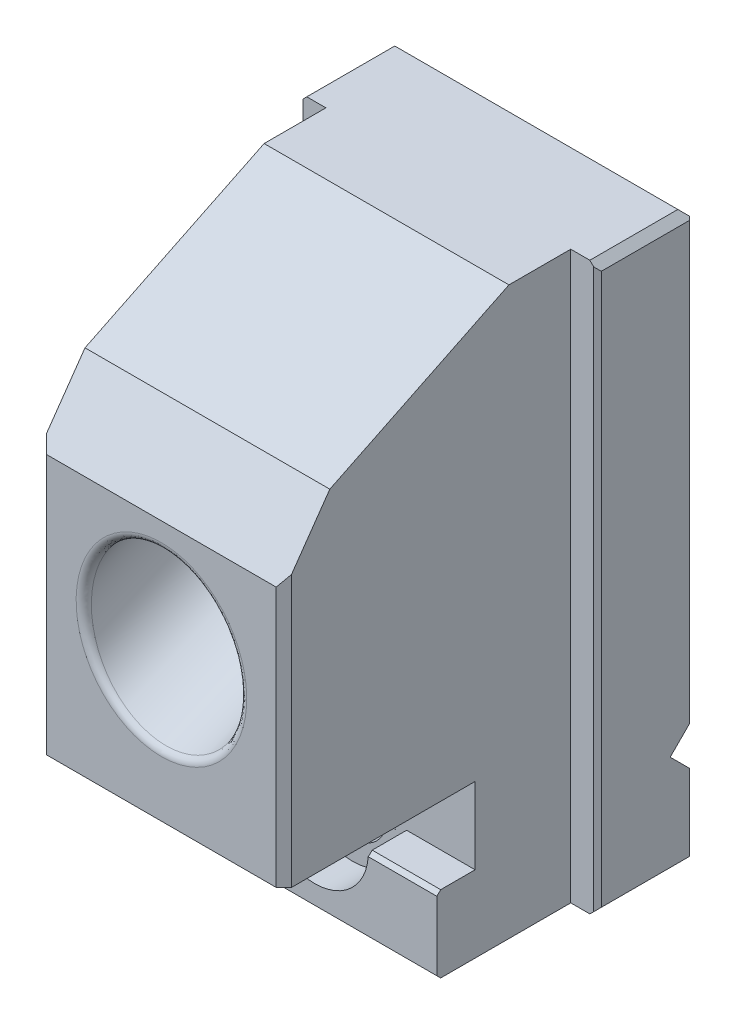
ISO-10303-21;
HEADER;
FILE_DESCRIPTION(('STEP AP214'),'2;1');
FILE_NAME('part.step','',(''),(''),'','','');
FILE_SCHEMA(('AUTOMOTIVE_DESIGN { 1 0 10303 214 1 1 1 1 }'));
ENDSEC;
DATA;
#1=APPLICATION_CONTEXT('core data for automotive mechanical design processes');
#2=APPLICATION_PROTOCOL_DEFINITION('international standard','automotive_design',2000,#1);
#3=PRODUCT_CONTEXT('',#1,'mechanical');
#4=PRODUCT('Part','Part','',(#3));
#5=PRODUCT_RELATED_PRODUCT_CATEGORY('part','',(#4));
#6=PRODUCT_DEFINITION_FORMATION('','',#4);
#7=PRODUCT_DEFINITION_CONTEXT('part definition',#1,'design');
#8=PRODUCT_DEFINITION('design','',#6,#7);
#9=PRODUCT_DEFINITION_SHAPE('','',#8);
#10=(LENGTH_UNIT() NAMED_UNIT(*) SI_UNIT(.MILLI.,.METRE.));
#11=(NAMED_UNIT(*) PLANE_ANGLE_UNIT() SI_UNIT($,.RADIAN.));
#12=(NAMED_UNIT(*) SI_UNIT($,.STERADIAN.) SOLID_ANGLE_UNIT());
#13=UNCERTAINTY_MEASURE_WITH_UNIT(LENGTH_MEASURE(1.E-05),#10,'distance_accuracy_value','');
#14=(GEOMETRIC_REPRESENTATION_CONTEXT(3) GLOBAL_UNCERTAINTY_ASSIGNED_CONTEXT((#13)) GLOBAL_UNIT_ASSIGNED_CONTEXT((#10,
#11,#12)) REPRESENTATION_CONTEXT('',''));
#15=CARTESIAN_POINT('',(0.,0.,0.));
#16=DIRECTION('',(0.,0.,1.));
#17=DIRECTION('',(1.,0.,0.));
#18=AXIS2_PLACEMENT_3D('',#15,#16,#17);
#19=CARTESIAN_POINT('',(60.3670308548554,5.08,-6.35));
#20=DIRECTION('',(0.,0.,-1.));
#21=DIRECTION('',(-1.,0.,0.));
#22=AXIS2_PLACEMENT_3D('',#19,#20,#21);
#23=PLANE('',#22);
#24=DIRECTION('',(-1.,0.,0.));
#25=VECTOR('',#24,1.);
#26=CARTESIAN_POINT('',(60.3670308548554,2.54,-6.35));
#27=LINE('',#26,#25);
#28=CARTESIAN_POINT('',(-1.7907,2.54,-6.35));
#29=VERTEX_POINT('',#28);
#30=CARTESIAN_POINT('',(-4.064,2.54,-6.35));
#31=VERTEX_POINT('',#30);
#32=EDGE_CURVE('E647',#29,#31,#27,.T.);
#33=ORIENTED_EDGE('',*,*,#32,.F.);
#34=CARTESIAN_POINT('',(0.,2.54,-6.35));
#35=DIRECTION('',(0.,0.,-1.));
#36=DIRECTION('',(-1.,0.,0.));
#37=AXIS2_PLACEMENT_3D('',#34,#35,#36);
#38=CIRCLE('',#37,1.7907);
#39=CARTESIAN_POINT('',(1.7907,2.54,-6.35));
#40=VERTEX_POINT('',#39);
#41=EDGE_CURVE('E357',#40,#29,#38,.T.);
#42=ORIENTED_EDGE('',*,*,#41,.F.);
#43=CARTESIAN_POINT('',(4.064,2.54,-6.35));
#44=VERTEX_POINT('',#43);
#45=EDGE_CURVE('E649',#44,#40,#27,.T.);
#46=ORIENTED_EDGE('',*,*,#45,.F.);
#47=DIRECTION('',(0.,1.,0.));
#48=VECTOR('',#47,1.);
#49=CARTESIAN_POINT('',(4.064,18.796,-6.35));
#50=LINE('',#49,#48);
#51=CARTESIAN_POINT('',(4.064,5.08,-6.35));
#52=VERTEX_POINT('',#51);
#53=EDGE_CURVE('E697',#44,#52,#50,.T.);
#54=ORIENTED_EDGE('',*,*,#53,.T.);
#55=DIRECTION('',(-1.,0.,0.));
#56=VECTOR('',#55,1.);
#57=CARTESIAN_POINT('',(60.3670308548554,5.08,-6.35));
#58=LINE('',#57,#56);
#59=CARTESIAN_POINT('',(-4.064,5.08,-6.35));
#60=VERTEX_POINT('',#59);
#61=EDGE_CURVE('E652',#52,#60,#58,.T.);
#62=ORIENTED_EDGE('',*,*,#61,.T.);
#63=DIRECTION('',(0.,-1.,0.));
#64=VECTOR('',#63,1.);
#65=CARTESIAN_POINT('',(-4.064,18.796,-6.35));
#66=LINE('',#65,#64);
#67=EDGE_CURVE('E669',#60,#31,#66,.T.);
#68=ORIENTED_EDGE('',*,*,#67,.T.);
#69=EDGE_LOOP('',(#33,#42,#46,#54,#62,#68));
#70=FACE_BOUND('',#69,.T.);
#71=CARTESIAN_POINT('',(0.,2.54,-6.35));
#72=DIRECTION('',(0.,0.,-1.));
#73=DIRECTION('',(-1.,0.,0.));
#74=AXIS2_PLACEMENT_3D('',#71,#72,#73);
#75=CIRCLE('',#74,1.1303);
#76=CARTESIAN_POINT('',(-1.1303,2.54,-6.35));
#77=VERTEX_POINT('',#76);
#78=EDGE_CURVE('E644',#77,#77,#75,.T.);
#79=ORIENTED_EDGE('',*,*,#78,.T.);
#80=EDGE_LOOP('',(#79));
#81=FACE_BOUND('',#80,.T.);
#82=CARTESIAN_POINT('',(0.,2.54,-6.35));
#83=DIRECTION('',(0.,0.,1.));
#84=DIRECTION('',(1.,0.,0.));
#85=AXIS2_PLACEMENT_3D('',#82,#83,#84);
#86=CIRCLE('',#85,1.422654);
#87=CARTESIAN_POINT('',(1.422654,2.54,-6.35));
#88=VERTEX_POINT('',#87);
#89=CARTESIAN_POINT('',(1.42265345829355,2.53875850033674,-6.35));
#90=VERTEX_POINT('',#89);
#91=EDGE_CURVE('E318',#88,#90,#86,.T.);
#92=ORIENTED_EDGE('',*,*,#91,.F.);
#93=DIRECTION('',(1.,0.,0.));
#94=VECTOR('',#93,1.);
#95=CARTESIAN_POINT('',(1.4224,2.54,-6.35));
#96=LINE('',#95,#94);
#97=CARTESIAN_POINT('',(1.4224,2.54,-6.35));
#98=VERTEX_POINT('',#97);
#99=EDGE_CURVE('E325',#88,#98,#96,.F.);
#100=ORIENTED_EDGE('',*,*,#99,.T.);
#101=CARTESIAN_POINT('',(0.,2.54,-6.35));
#102=DIRECTION('',(0.,0.,1.));
#103=DIRECTION('',(1.,0.,0.));
#104=AXIS2_PLACEMENT_3D('',#101,#102,#103);
#105=CIRCLE('',#104,1.4224);
#106=CARTESIAN_POINT('',(1.42239945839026,2.53875872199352,-6.35));
#107=VERTEX_POINT('',#106);
#108=EDGE_CURVE('E338',#98,#107,#105,.T.);
#109=ORIENTED_EDGE('',*,*,#108,.T.);
#110=DIRECTION('',(0.99999961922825,-0.000872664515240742,0.));
#111=VECTOR('',#110,1.);
#112=CARTESIAN_POINT('',(1.42239945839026,2.53875872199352,-6.35));
#113=LINE('',#112,#111);
#114=EDGE_CURVE('E329',#90,#107,#113,.F.);
#115=ORIENTED_EDGE('',*,*,#114,.F.);
#116=EDGE_LOOP('',(#92,#100,#109,#115));
#117=FACE_BOUND('',#116,.T.);
#118=ADVANCED_FACE('F15',(#70,#81,#117),#23,.F.);
#119=CARTESIAN_POINT('',(-254.,4.191,-12.7));
#120=DIRECTION('',(0.,0.707106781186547,0.707106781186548));
#121=DIRECTION('',(0.,-0.707106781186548,0.707106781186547));
#122=AXIS2_PLACEMENT_3D('',#119,#120,#121);
#123=PLANE('',#122);
#124=CARTESIAN_POINT('',(0.,2.54,-11.049));
#125=DIRECTION('',(0.,0.707106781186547,0.707106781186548));
#126=DIRECTION('',(0.,-0.707106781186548,0.707106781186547));
#127=AXIS2_PLACEMENT_3D('',#124,#125,#126);
#128=ELLIPSE('',#127,2.01157737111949,1.4224);
#129=CARTESIAN_POINT('',(1.11036064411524,3.429,-11.938));
#130=VERTEX_POINT('',#129);
#131=CARTESIAN_POINT('',(-1.11036064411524,3.429,-11.938));
#132=VERTEX_POINT('',#131);
#133=EDGE_CURVE('E351',#130,#132,#128,.T.);
#134=ORIENTED_EDGE('',*,*,#133,.F.);
#135=DIRECTION('',(1.,0.,0.));
#136=VECTOR('',#135,1.);
#137=CARTESIAN_POINT('',(-254.,3.429,-11.938));
#138=LINE('',#137,#136);
#139=CARTESIAN_POINT('',(0.698038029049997,3.429,-11.938));
#140=VERTEX_POINT('',#139);
#141=EDGE_CURVE('E627',#140,#130,#138,.T.);
#142=ORIENTED_EDGE('',*,*,#141,.F.);
#143=CARTESIAN_POINT('',(0.,2.54,-11.049));
#144=DIRECTION('',(0.,0.707106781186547,0.707106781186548));
#145=DIRECTION('',(0.,-0.707106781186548,0.707106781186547));
#146=AXIS2_PLACEMENT_3D('',#143,#144,#145);
#147=ELLIPSE('',#146,1.59848558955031,1.1303);
#148=CARTESIAN_POINT('',(-0.698038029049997,3.429,-11.938));
#149=VERTEX_POINT('',#148);
#150=EDGE_CURVE('E624',#149,#140,#147,.F.);
#151=ORIENTED_EDGE('',*,*,#150,.F.);
#152=EDGE_CURVE('E619',#132,#149,#138,.T.);
#153=ORIENTED_EDGE('',*,*,#152,.F.);
#154=EDGE_LOOP('',(#134,#142,#151,#153));
#155=FACE_BOUND('',#154,.T.);
#156=ADVANCED_FACE('F432',(#155),#123,.F.);
#157=CARTESIAN_POINT('',(-254.,2.667,-12.7));
#158=DIRECTION('',(0.,0.707106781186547,-0.707106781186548));
#159=DIRECTION('',(0.,0.707106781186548,0.707106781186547));
#160=AXIS2_PLACEMENT_3D('',#157,#158,#159);
#161=PLANE('',#160);
#162=CARTESIAN_POINT('',(-0.967619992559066,3.1242,-12.2428));
#163=CARTESIAN_POINT('',(-1.02603354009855,3.09119059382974,-12.2758094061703));
#164=CARTESIAN_POINT('',(-1.08238094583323,3.05644695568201,-12.310553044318));
#165=CARTESIAN_POINT('',(-1.19120536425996,2.98430633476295,-12.3826936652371));
#166=CARTESIAN_POINT('',(-1.24369559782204,2.94691936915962,-12.4200806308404));
#167=CARTESIAN_POINT('',(-1.34540218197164,2.87011966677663,-12.4968803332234));
#168=CARTESIAN_POINT('',(-1.39462354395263,2.83071020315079,-12.5362897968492));
#169=CARTESIAN_POINT('',(-1.49044400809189,2.75008100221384,-12.6169189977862));
#170=CARTESIAN_POINT('',(-1.53703304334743,2.70885526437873,-12.6581447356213));
#171=CARTESIAN_POINT('',(-1.58241184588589,2.667,-12.7));
#172=B_SPLINE_CURVE_WITH_KNOTS('',3,(#162,#163,#164,#165,#166,#167,#168,#169,#170,#171),
.UNSPECIFIED.,.F.,.F.,(4,2,2,2,4),(0.,0.224139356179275,0.447470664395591,0.670451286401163,
0.894233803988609),.UNSPECIFIED.);
#173=CARTESIAN_POINT('',(-0.967619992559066,3.1242,-12.2428));
#174=VERTEX_POINT('',#173);
#175=CARTESIAN_POINT('',(-1.39208453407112,2.8321,-12.5349));
#176=VERTEX_POINT('',#175);
#177=EDGE_CURVE('E570',#174,#176,#172,.T.);
#178=ORIENTED_EDGE('',*,*,#177,.T.);
#179=CARTESIAN_POINT('',(0.,2.54,-12.827));
#180=DIRECTION('',(0.,0.707106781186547,-0.707106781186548));
#181=DIRECTION('',(0.,0.707106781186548,0.707106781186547));
#182=AXIS2_PLACEMENT_3D('',#179,#180,#181);
#183=ELLIPSE('',#182,2.01157737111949,1.4224);
#184=EDGE_CURVE('E353',#176,#132,#183,.T.);
#185=ORIENTED_EDGE('',*,*,#184,.T.);
#186=ORIENTED_EDGE('',*,*,#152,.T.);
#187=CARTESIAN_POINT('',(0.,2.54,-12.827));
#188=DIRECTION('',(0.,0.707106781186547,-0.707106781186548));
#189=DIRECTION('',(0.,0.707106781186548,0.707106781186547));
#190=AXIS2_PLACEMENT_3D('',#187,#188,#189);
#191=ELLIPSE('',#190,1.59848558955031,1.1303);
#192=EDGE_CURVE('E725',#149,#174,#191,.F.);
#193=ORIENTED_EDGE('',*,*,#192,.T.);
#194=EDGE_LOOP('',(#178,#185,#186,#193));
#195=FACE_BOUND('',#194,.T.);
#196=ADVANCED_FACE('F438',(#195),#161,.T.);
#197=ORIENTED_EDGE('',*,*,#141,.T.);
#198=CARTESIAN_POINT('',(0.,2.54,-12.827));
#199=DIRECTION('',(0.,0.707106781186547,-0.707106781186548));
#200=DIRECTION('',(0.,0.707106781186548,0.707106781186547));
#201=AXIS2_PLACEMENT_3D('',#198,#199,#200);
#202=ELLIPSE('',#201,2.01157737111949,1.4224);
#203=CARTESIAN_POINT('',(1.39208453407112,2.8321,-12.5349));
#204=VERTEX_POINT('',#203);
#205=EDGE_CURVE('E348',#130,#204,#202,.T.);
#206=ORIENTED_EDGE('',*,*,#205,.T.);
#207=CARTESIAN_POINT('',(1.58241184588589,2.667,-12.7));
#208=CARTESIAN_POINT('',(1.53703304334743,2.70885526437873,-12.6581447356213));
#209=CARTESIAN_POINT('',(1.4904440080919,2.75008100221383,-12.6169189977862));
#210=CARTESIAN_POINT('',(1.39462354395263,2.83071020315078,-12.5362897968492));
#211=CARTESIAN_POINT('',(1.34540218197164,2.87011966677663,-12.4968803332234));
#212=CARTESIAN_POINT('',(1.24369559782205,2.94691936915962,-12.4200806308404));
#213=CARTESIAN_POINT('',(1.19120536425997,2.98430633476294,-12.3826936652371));
#214=CARTESIAN_POINT('',(1.08238094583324,3.05644695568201,-12.310553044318));
#215=CARTESIAN_POINT('',(1.02603354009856,3.09119059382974,-12.2758094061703));
#216=CARTESIAN_POINT('',(0.967619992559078,3.1242,-12.2428));
#217=B_SPLINE_CURVE_WITH_KNOTS('',3,(#207,#208,#209,#210,#211,#212,#213,#214,#215,#216),
.UNSPECIFIED.,.F.,.F.,(4,2,2,2,4),(0.,0.223782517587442,0.446763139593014,0.670094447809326,
0.894233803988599),.UNSPECIFIED.);
#218=CARTESIAN_POINT('',(0.967619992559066,3.1242,-12.2428));
#219=VERTEX_POINT('',#218);
#220=EDGE_CURVE('E600',#204,#219,#217,.T.);
#221=ORIENTED_EDGE('',*,*,#220,.T.);
#222=EDGE_CURVE('E723',#219,#140,#191,.F.);
#223=ORIENTED_EDGE('',*,*,#222,.T.);
#224=EDGE_LOOP('',(#197,#206,#221,#223));
#225=FACE_BOUND('',#224,.T.);
#226=ADVANCED_FACE('F587',(#225),#161,.T.);
#227=CARTESIAN_POINT('',(0.,2.54,-12.2428));
#228=DIRECTION('',(0.,0.,-1.));
#229=DIRECTION('',(-1.,0.,0.));
#230=AXIS2_PLACEMENT_3D('',#227,#228,#229);
#231=CONICAL_SURFACE('',#230,1.1303,0.785398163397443);
#232=DIRECTION('',(-0.707106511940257,0.000617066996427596,0.707106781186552));
#233=VECTOR('',#232,1.);
#234=CARTESIAN_POINT('',(0.,2.54,-11.1125));
#235=LINE('',#234,#233);
#236=CARTESIAN_POINT('',(1.42265345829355,2.53875850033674,-12.535154));
#237=VERTEX_POINT('',#236);
#238=CARTESIAN_POINT('',(1.42239945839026,2.53875872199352,-12.5349));
#239=VERTEX_POINT('',#238);
#240=EDGE_CURVE('E19',#237,#239,#235,.T.);
#241=ORIENTED_EDGE('',*,*,#240,.T.);
#242=CARTESIAN_POINT('',(0.,2.54,-12.5349));
#243=DIRECTION('',(0.,0.,-1.));
#244=DIRECTION('',(-1.,0.,0.));
#245=AXIS2_PLACEMENT_3D('',#242,#243,#244);
#246=CIRCLE('',#245,1.4224);
#247=EDGE_CURVE('E9',#239,#176,#246,.T.);
#248=ORIENTED_EDGE('',*,*,#247,.T.);
#249=ORIENTED_EDGE('',*,*,#177,.F.);
#250=CARTESIAN_POINT('',(0.,2.54,-12.2428));
#251=DIRECTION('',(0.,0.,-1.));
#252=DIRECTION('',(-1.,0.,0.));
#253=AXIS2_PLACEMENT_3D('',#250,#251,#252);
#254=CIRCLE('',#253,1.1303);
#255=EDGE_CURVE('E566',#219,#174,#254,.T.);
#256=ORIENTED_EDGE('',*,*,#255,.F.);
#257=ORIENTED_EDGE('',*,*,#220,.F.);
#258=CARTESIAN_POINT('',(1.4224,2.54,-12.5349));
#259=VERTEX_POINT('',#258);
#260=EDGE_CURVE('E24',#204,#259,#246,.T.);
#261=ORIENTED_EDGE('',*,*,#260,.T.);
#262=DIRECTION('',(-0.707106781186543,0.,0.707106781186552));
#263=VECTOR('',#262,1.);
#264=CARTESIAN_POINT('',(0.,2.54,-11.1125));
#265=LINE('',#264,#263);
#266=CARTESIAN_POINT('',(1.422654,2.54,-12.535154));
#267=VERTEX_POINT('',#266);
#268=EDGE_CURVE('E602',#259,#267,#265,.F.);
#269=ORIENTED_EDGE('',*,*,#268,.T.);
#270=CARTESIAN_POINT('',(0.,2.54,-12.535154));
#271=DIRECTION('',(0.,0.,-1.));
#272=DIRECTION('',(-1.,0.,0.));
#273=AXIS2_PLACEMENT_3D('',#270,#271,#272);
#274=CIRCLE('',#273,1.422654);
#275=CARTESIAN_POINT('',(1.39239732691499,2.831846,-12.535154));
#276=VERTEX_POINT('',#275);
#277=EDGE_CURVE('E320',#276,#267,#274,.T.);
#278=ORIENTED_EDGE('',*,*,#277,.F.);
#279=CARTESIAN_POINT('',(1.58241184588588,2.667,-12.7));
#280=VERTEX_POINT('',#279);
#281=EDGE_CURVE('E593',#280,#276,#217,.T.);
#282=ORIENTED_EDGE('',*,*,#281,.F.);
#283=CARTESIAN_POINT('',(0.,2.54,-12.7));
#284=DIRECTION('',(0.,0.,-1.));
#285=DIRECTION('',(-1.,0.,0.));
#286=AXIS2_PLACEMENT_3D('',#283,#284,#285);
#287=CIRCLE('',#286,1.5875);
#288=CARTESIAN_POINT('',(-1.58241184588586,2.667,-12.7));
#289=VERTEX_POINT('',#288);
#290=EDGE_CURVE('E578',#289,#280,#287,.F.);
#291=ORIENTED_EDGE('',*,*,#290,.F.);
#292=CARTESIAN_POINT('',(-1.39239732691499,2.831846,-12.535154));
#293=VERTEX_POINT('',#292);
#294=EDGE_CURVE('E569',#293,#289,#172,.T.);
#295=ORIENTED_EDGE('',*,*,#294,.F.);
#296=EDGE_CURVE('E603',#237,#293,#274,.T.);
#297=ORIENTED_EDGE('',*,*,#296,.F.);
#298=EDGE_LOOP('',(#241,#248,#249,#256,#257,#261,#269,#278,#282,#291,#295,#297));
#299=FACE_BOUND('',#298,.T.);
#300=ADVANCED_FACE('F582',(#299),#231,.F.);
#301=CARTESIAN_POINT('',(-4.9657,18.796,-12.7));
#302=DIRECTION('',(0.,0.,-1.));
#303=DIRECTION('',(-1.,0.,0.));
#304=AXIS2_PLACEMENT_3D('',#301,#302,#303);
#305=PLANE('',#304);
#306=DIRECTION('',(1.,0.,0.));
#307=VECTOR('',#306,1.);
#308=CARTESIAN_POINT('',(-254.,2.667,-12.7));
#309=LINE('',#308,#307);
#310=CARTESIAN_POINT('',(-4.826,2.667,-12.7));
#311=VERTEX_POINT('',#310);
#312=EDGE_CURVE('E633',#311,#289,#309,.T.);
#313=ORIENTED_EDGE('',*,*,#312,.T.);
#314=ORIENTED_EDGE('',*,*,#290,.T.);
#315=CARTESIAN_POINT('',(4.826,2.667,-12.7));
#316=VERTEX_POINT('',#315);
#317=EDGE_CURVE('E639',#280,#316,#309,.T.);
#318=ORIENTED_EDGE('',*,*,#317,.T.);
#319=DIRECTION('',(0.,-1.,0.));
#320=VECTOR('',#319,1.);
#321=CARTESIAN_POINT('',(4.826,18.796,-12.7));
#322=LINE('',#321,#320);
#323=CARTESIAN_POINT('',(4.826,0.254,-12.7));
#324=VERTEX_POINT('',#323);
#325=EDGE_CURVE('E515',#316,#324,#322,.T.);
#326=ORIENTED_EDGE('',*,*,#325,.T.);
#327=DIRECTION('',(-1.,0.,0.));
#328=VECTOR('',#327,1.);
#329=CARTESIAN_POINT('',(-4.9657,0.254,-12.7));
#330=LINE('',#329,#328);
#331=CARTESIAN_POINT('',(-4.826,0.254,-12.7));
#332=VERTEX_POINT('',#331);
#333=EDGE_CURVE('E766',#324,#332,#330,.T.);
#334=ORIENTED_EDGE('',*,*,#333,.T.);
#335=DIRECTION('',(0.,1.,0.));
#336=VECTOR('',#335,1.);
#337=CARTESIAN_POINT('',(-4.826,18.796,-12.7));
#338=LINE('',#337,#336);
#339=EDGE_CURVE('E513',#332,#311,#338,.T.);
#340=ORIENTED_EDGE('',*,*,#339,.T.);
#341=EDGE_LOOP('',(#313,#314,#318,#326,#334,#340));
#342=FACE_BOUND('',#341,.T.);
#343=ADVANCED_FACE('F428',(#342),#305,.T.);
#344=CARTESIAN_POINT('',(0.,2.54,-68.1013308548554));
#345=DIRECTION('',(0.,0.,1.));
#346=DIRECTION('',(1.,0.,0.));
#347=AXIS2_PLACEMENT_3D('',#344,#345,#346);
#348=CYLINDRICAL_SURFACE('',#347,1.1303);
#349=ORIENTED_EDGE('',*,*,#78,.F.);
#350=EDGE_LOOP('',(#349));
#351=FACE_BOUND('',#350,.T.);
#352=ORIENTED_EDGE('',*,*,#222,.F.);
#353=ORIENTED_EDGE('',*,*,#255,.T.);
#354=ORIENTED_EDGE('',*,*,#192,.F.);
#355=ORIENTED_EDGE('',*,*,#150,.T.);
#356=EDGE_LOOP('',(#352,#353,#354,#355));
#357=FACE_BOUND('',#356,.T.);
#358=ADVANCED_FACE('F1115',(#351,#357),#348,.F.);
#359=CARTESIAN_POINT('',(60.3670308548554,2.54,-6.35));
#360=DIRECTION('',(0.,-1.,0.));
#361=DIRECTION('',(0.,0.,-1.));
#362=AXIS2_PLACEMENT_3D('',#359,#360,#361);
#363=PLANE('',#362);
#364=ORIENTED_EDGE('',*,*,#45,.T.);
#365=DIRECTION('',(0.,0.,-1.));
#366=VECTOR('',#365,1.);
#367=CARTESIAN_POINT('',(1.7907,2.54,-5.08));
#368=LINE('',#367,#366);
#369=CARTESIAN_POINT('',(1.7907,2.54,-5.207));
#370=VERTEX_POINT('',#369);
#371=EDGE_CURVE('E366',#40,#370,#368,.F.);
#372=ORIENTED_EDGE('',*,*,#371,.T.);
#373=DIRECTION('',(1.,0.,0.));
#374=VECTOR('',#373,1.);
#375=CARTESIAN_POINT('',(60.3670308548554,2.54,-5.207));
#376=LINE('',#375,#374);
#377=CARTESIAN_POINT('',(4.064,2.54,-5.207));
#378=VERTEX_POINT('',#377);
#379=EDGE_CURVE('E712',#370,#378,#376,.T.);
#380=ORIENTED_EDGE('',*,*,#379,.T.);
#381=DIRECTION('',(0.,0.,-1.));
#382=VECTOR('',#381,1.);
#383=CARTESIAN_POINT('',(4.064,2.54,-9.525));
#384=LINE('',#383,#382);
#385=EDGE_CURVE('E695',#378,#44,#384,.T.);
#386=ORIENTED_EDGE('',*,*,#385,.T.);
#387=EDGE_LOOP('',(#364,#372,#380,#386));
#388=FACE_BOUND('',#387,.T.);
#389=ADVANCED_FACE('F918',(#388),#363,.F.);
#390=CARTESIAN_POINT('',(60.3670308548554,2.413,-5.08));
#391=DIRECTION('',(0.,-0.707106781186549,-0.707106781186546));
#392=DIRECTION('',(0.,0.707106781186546,-0.707106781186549));
#393=AXIS2_PLACEMENT_3D('',#390,#391,#392);
#394=PLANE('',#393);
#395=CARTESIAN_POINT('',(0.,2.54,-5.207));
#396=DIRECTION('',(0.,-0.707106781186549,-0.707106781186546));
#397=DIRECTION('',(0.,0.707106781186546,-0.707106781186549));
#398=AXIS2_PLACEMENT_3D('',#395,#396,#397);
#399=ELLIPSE('',#398,2.5324322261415,1.7907);
#400=CARTESIAN_POINT('',(1.78619077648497,2.413,-5.08));
#401=VERTEX_POINT('',#400);
#402=EDGE_CURVE('E364',#401,#370,#399,.F.);
#403=ORIENTED_EDGE('',*,*,#402,.F.);
#404=DIRECTION('',(-1.,0.,0.));
#405=VECTOR('',#404,1.);
#406=CARTESIAN_POINT('',(60.3670308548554,2.413,-5.08));
#407=LINE('',#406,#405);
#408=CARTESIAN_POINT('',(4.064,2.413,-5.08));
#409=VERTEX_POINT('',#408);
#410=EDGE_CURVE('E705',#409,#401,#407,.T.);
#411=ORIENTED_EDGE('',*,*,#410,.F.);
#412=DIRECTION('',(0.,0.707106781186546,-0.707106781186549));
#413=VECTOR('',#412,1.);
#414=CARTESIAN_POINT('',(4.064,12.827,-15.494));
#415=LINE('',#414,#413);
#416=EDGE_CURVE('E718',#378,#409,#415,.F.);
#417=ORIENTED_EDGE('',*,*,#416,.F.);
#418=ORIENTED_EDGE('',*,*,#379,.F.);
#419=EDGE_LOOP('',(#403,#411,#417,#418));
#420=FACE_BOUND('',#419,.T.);
#421=ADVANCED_FACE('F458',(#420),#394,.F.);
#422=CARTESIAN_POINT('',(4.064,0.,-9.525));
#423=DIRECTION('',(0.,-1.,0.));
#424=DIRECTION('',(0.,0.,-1.));
#425=AXIS2_PLACEMENT_3D('',#422,#423,#424);
#426=PLANE('',#425);
#427=DIRECTION('',(-1.,0.,0.));
#428=VECTOR('',#427,1.);
#429=CARTESIAN_POINT('',(-4.064,0.,-9.525));
#430=LINE('',#429,#428);
#431=CARTESIAN_POINT('',(-4.064,0.,-9.525));
#432=VERTEX_POINT('',#431);
#433=CARTESIAN_POINT('',(-4.699,0.,-9.525));
#434=VERTEX_POINT('',#433);
#435=EDGE_CURVE('E679',#432,#434,#430,.T.);
#436=ORIENTED_EDGE('',*,*,#435,.T.);
#437=DIRECTION('',(0.,0.,-1.));
#438=VECTOR('',#437,1.);
#439=CARTESIAN_POINT('',(-4.699,0.,-9.525));
#440=LINE('',#439,#438);
#441=CARTESIAN_POINT('',(-4.699,0.,-12.446));
#442=VERTEX_POINT('',#441);
#443=EDGE_CURVE('E786',#434,#442,#440,.T.);
#444=ORIENTED_EDGE('',*,*,#443,.T.);
#445=DIRECTION('',(1.,0.,0.));
#446=VECTOR('',#445,1.);
#447=CARTESIAN_POINT('',(4.064,0.,-12.446));
#448=LINE('',#447,#446);
#449=CARTESIAN_POINT('',(4.699,0.,-12.446));
#450=VERTEX_POINT('',#449);
#451=EDGE_CURVE('E763',#442,#450,#448,.T.);
#452=ORIENTED_EDGE('',*,*,#451,.T.);
#453=DIRECTION('',(0.,0.,1.));
#454=VECTOR('',#453,1.);
#455=CARTESIAN_POINT('',(4.699,0.,-9.525));
#456=LINE('',#455,#454);
#457=CARTESIAN_POINT('',(4.699,0.,-9.525));
#458=VERTEX_POINT('',#457);
#459=EDGE_CURVE('E784',#450,#458,#456,.T.);
#460=ORIENTED_EDGE('',*,*,#459,.T.);
#461=DIRECTION('',(-1.,0.,0.));
#462=VECTOR('',#461,1.);
#463=CARTESIAN_POINT('',(4.9657,0.,-9.525));
#464=LINE('',#463,#462);
#465=CARTESIAN_POINT('',(4.064,0.,-9.525));
#466=VERTEX_POINT('',#465);
#467=EDGE_CURVE('E478',#458,#466,#464,.T.);
#468=ORIENTED_EDGE('',*,*,#467,.T.);
#469=DIRECTION('',(0.,0.,1.));
#470=VECTOR('',#469,1.);
#471=CARTESIAN_POINT('',(4.064,0.,-9.525));
#472=LINE('',#471,#470);
#473=CARTESIAN_POINT('',(4.064,0.,-5.207));
#474=VERTEX_POINT('',#473);
#475=EDGE_CURVE('E676',#466,#474,#472,.T.);
#476=ORIENTED_EDGE('',*,*,#475,.T.);
#477=DIRECTION('',(-1.,0.,0.));
#478=VECTOR('',#477,1.);
#479=CARTESIAN_POINT('',(-4.064,0.,-5.207));
#480=LINE('',#479,#478);
#481=CARTESIAN_POINT('',(-4.064,0.,-5.207));
#482=VERTEX_POINT('',#481);
#483=EDGE_CURVE('E720',#474,#482,#480,.T.);
#484=ORIENTED_EDGE('',*,*,#483,.T.);
#485=DIRECTION('',(0.,0.,-1.));
#486=VECTOR('',#485,1.);
#487=CARTESIAN_POINT('',(-4.064,0.,0.));
#488=LINE('',#487,#486);
#489=EDGE_CURVE('E677',#482,#432,#488,.T.);
#490=ORIENTED_EDGE('',*,*,#489,.T.);
#491=EDGE_LOOP('',(#436,#444,#452,#460,#468,#476,#484,#490));
#492=FACE_BOUND('',#491,.T.);
#493=ADVANCED_FACE('F416',(#492),#426,.T.);
#494=CARTESIAN_POINT('',(4.064,18.796,-9.525));
#495=DIRECTION('',(0.,-1.,0.));
#496=DIRECTION('',(0.,0.,-1.));
#497=AXIS2_PLACEMENT_3D('',#494,#495,#496);
#498=PLANE('',#497);
#499=DIRECTION('',(-1.,0.,0.));
#500=VECTOR('',#499,1.);
#501=CARTESIAN_POINT('',(4.064,18.796,-9.525));
#502=LINE('',#501,#500);
#503=CARTESIAN_POINT('',(4.699,18.796,-9.525));
#504=VERTEX_POINT('',#503);
#505=CARTESIAN_POINT('',(4.064,18.796,-9.525));
#506=VERTEX_POINT('',#505);
#507=EDGE_CURVE('E689',#504,#506,#502,.T.);
#508=ORIENTED_EDGE('',*,*,#507,.F.);
#509=DIRECTION('',(0.,0.,-1.));
#510=VECTOR('',#509,1.);
#511=CARTESIAN_POINT('',(4.699,18.796,-12.446));
#512=LINE('',#511,#510);
#513=CARTESIAN_POINT('',(4.699,18.796,-12.446));
#514=VERTEX_POINT('',#513);
#515=EDGE_CURVE('E777',#504,#514,#512,.T.);
#516=ORIENTED_EDGE('',*,*,#515,.T.);
#517=DIRECTION('',(-1.,0.,0.));
#518=VECTOR('',#517,1.);
#519=CARTESIAN_POINT('',(-4.953,18.796,-12.446));
#520=LINE('',#519,#518);
#521=CARTESIAN_POINT('',(-4.699,18.796,-12.446));
#522=VERTEX_POINT('',#521);
#523=EDGE_CURVE('E760',#514,#522,#520,.T.);
#524=ORIENTED_EDGE('',*,*,#523,.T.);
#525=DIRECTION('',(0.,0.,1.));
#526=VECTOR('',#525,1.);
#527=CARTESIAN_POINT('',(-4.699,18.796,-9.525));
#528=LINE('',#527,#526);
#529=CARTESIAN_POINT('',(-4.699,18.796,-9.525));
#530=VERTEX_POINT('',#529);
#531=EDGE_CURVE('E775',#522,#530,#528,.T.);
#532=ORIENTED_EDGE('',*,*,#531,.T.);
#533=DIRECTION('',(-1.,0.,0.));
#534=VECTOR('',#533,1.);
#535=CARTESIAN_POINT('',(4.064,18.796,-9.525));
#536=LINE('',#535,#534);
#537=CARTESIAN_POINT('',(-4.064,18.796,-9.525));
#538=VERTEX_POINT('',#537);
#539=EDGE_CURVE('E728',#538,#530,#536,.T.);
#540=ORIENTED_EDGE('',*,*,#539,.F.);
#541=DIRECTION('',(0.,0.,-1.));
#542=VECTOR('',#541,1.);
#543=CARTESIAN_POINT('',(-4.064,18.796,-9.525));
#544=LINE('',#543,#542);
#545=CARTESIAN_POINT('',(-4.064,18.796,-7.47309145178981));
#546=VERTEX_POINT('',#545);
#547=EDGE_CURVE('E731',#546,#538,#544,.T.);
#548=ORIENTED_EDGE('',*,*,#547,.F.);
#549=DIRECTION('',(1.,0.,0.));
#550=VECTOR('',#549,1.);
#551=CARTESIAN_POINT('',(4.064,18.796,-7.47309145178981));
#552=LINE('',#551,#550);
#553=CARTESIAN_POINT('',(4.064,18.796,-7.47309145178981));
#554=VERTEX_POINT('',#553);
#555=EDGE_CURVE('E672',#546,#554,#552,.T.);
#556=ORIENTED_EDGE('',*,*,#555,.T.);
#557=DIRECTION('',(0.,0.,1.));
#558=VECTOR('',#557,1.);
#559=CARTESIAN_POINT('',(4.064,18.796,-9.525));
#560=LINE('',#559,#558);
#561=EDGE_CURVE('E683',#506,#554,#560,.T.);
#562=ORIENTED_EDGE('',*,*,#561,.F.);
#563=EDGE_LOOP('',(#508,#516,#524,#532,#540,#548,#556,#562));
#564=FACE_BOUND('',#563,.T.);
#565=ADVANCED_FACE('F414',(#564),#498,.F.);
#566=CARTESIAN_POINT('',(-4.064,18.796,0.));
#567=DIRECTION('',(-1.,0.,0.));
#568=DIRECTION('',(0.,0.,1.));
#569=AXIS2_PLACEMENT_3D('',#566,#567,#568);
#570=PLANE('',#569);
#571=DIRECTION('',(0.,0.,-1.));
#572=VECTOR('',#571,1.);
#573=CARTESIAN_POINT('',(-4.064,5.08,0.));
#574=LINE('',#573,#572);
#575=CARTESIAN_POINT('',(-4.064,5.08,-0.254));
#576=VERTEX_POINT('',#575);
#577=EDGE_CURVE('E661',#576,#60,#574,.T.);
#578=ORIENTED_EDGE('',*,*,#577,.F.);
#579=DIRECTION('',(0.,1.,0.));
#580=VECTOR('',#579,1.);
#581=CARTESIAN_POINT('',(-4.064,18.796,-0.254));
#582=LINE('',#581,#580);
#583=CARTESIAN_POINT('',(-4.064,14.0787495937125,-0.254));
#584=VERTEX_POINT('',#583);
#585=EDGE_CURVE('E562',#576,#584,#582,.T.);
#586=ORIENTED_EDGE('',*,*,#585,.T.);
#587=DIRECTION('',(0.,0.819152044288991,-0.573576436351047));
#588=VECTOR('',#587,1.);
#589=CARTESIAN_POINT('',(-4.064,13.716,0.));
#590=LINE('',#589,#588);
#591=CARTESIAN_POINT('',(-4.064,15.895438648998,-1.52605937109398));
#592=VERTEX_POINT('',#591);
#593=EDGE_CURVE('E370',#584,#592,#590,.T.);
#594=ORIENTED_EDGE('',*,*,#593,.T.);
#595=DIRECTION('',(0.,-0.438371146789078,0.898794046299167));
#596=VECTOR('',#595,1.);
#597=CARTESIAN_POINT('',(-4.064,15.8515617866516,-1.43609847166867));
#598=LINE('',#597,#596);
#599=EDGE_CURVE('E673',#546,#592,#598,.T.);
#600=ORIENTED_EDGE('',*,*,#599,.F.);
#601=ORIENTED_EDGE('',*,*,#547,.T.);
#602=DIRECTION('',(0.,-1.,0.));
#603=VECTOR('',#602,1.);
#604=CARTESIAN_POINT('',(-4.064,18.796,-9.525));
#605=LINE('',#604,#603);
#606=EDGE_CURVE('E688',#538,#432,#605,.T.);
#607=ORIENTED_EDGE('',*,*,#606,.T.);
#608=ORIENTED_EDGE('',*,*,#489,.F.);
#609=DIRECTION('',(0.,0.707106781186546,0.707106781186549));
#610=VECTOR('',#609,1.);
#611=CARTESIAN_POINT('',(-4.064,12.0015,6.7945));
#612=LINE('',#611,#610);
#613=CARTESIAN_POINT('',(-4.064,0.126999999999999,-5.08));
#614=VERTEX_POINT('',#613);
#615=EDGE_CURVE('E708',#482,#614,#612,.T.);
#616=ORIENTED_EDGE('',*,*,#615,.T.);
#617=DIRECTION('',(0.,-1.,0.));
#618=VECTOR('',#617,1.);
#619=CARTESIAN_POINT('',(-4.064,18.796,-5.08));
#620=LINE('',#619,#618);
#621=CARTESIAN_POINT('',(-4.064,2.413,-5.08));
#622=VERTEX_POINT('',#621);
#623=EDGE_CURVE('E663',#622,#614,#620,.T.);
#624=ORIENTED_EDGE('',*,*,#623,.F.);
#625=DIRECTION('',(0.,-0.707106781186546,0.707106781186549));
#626=VECTOR('',#625,1.);
#627=CARTESIAN_POINT('',(-4.064,8.0645,-10.7315));
#628=LINE('',#627,#626);
#629=CARTESIAN_POINT('',(-4.064,2.54,-5.207));
#630=VERTEX_POINT('',#629);
#631=EDGE_CURVE('E710',#622,#630,#628,.F.);
#632=ORIENTED_EDGE('',*,*,#631,.T.);
#633=DIRECTION('',(0.,0.,1.));
#634=VECTOR('',#633,1.);
#635=CARTESIAN_POINT('',(-4.064,2.54,0.));
#636=LINE('',#635,#634);
#637=EDGE_CURVE('E666',#31,#630,#636,.T.);
#638=ORIENTED_EDGE('',*,*,#637,.F.);
#639=ORIENTED_EDGE('',*,*,#67,.F.);
#640=EDGE_LOOP('',(#578,#586,#594,#600,#601,#607,#608,#616,#624,#632,#638,#639));
#641=FACE_BOUND('',#640,.T.);
#642=ADVANCED_FACE('F409',(#641),#570,.T.);
#643=CARTESIAN_POINT('',(4.064,18.796,-9.525));
#644=DIRECTION('',(1.,0.,0.));
#645=DIRECTION('',(0.,0.,-1.));
#646=AXIS2_PLACEMENT_3D('',#643,#644,#645);
#647=PLANE('',#646);
#648=DIRECTION('',(0.,0.819152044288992,-0.573576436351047));
#649=VECTOR('',#648,1.);
#650=CARTESIAN_POINT('',(4.064,21.6000172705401,-5.52044832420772));
#651=LINE('',#650,#649);
#652=CARTESIAN_POINT('',(4.064,14.0787495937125,-0.254));
#653=VERTEX_POINT('',#652);
#654=CARTESIAN_POINT('',(4.064,15.895438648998,-1.52605937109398));
#655=VERTEX_POINT('',#654);
#656=EDGE_CURVE('E375',#653,#655,#651,.T.);
#657=ORIENTED_EDGE('',*,*,#656,.F.);
#658=DIRECTION('',(0.,-1.,0.));
#659=VECTOR('',#658,1.);
#660=CARTESIAN_POINT('',(4.064,18.796,-0.254));
#661=LINE('',#660,#659);
#662=CARTESIAN_POINT('',(4.064,5.08,-0.254));
#663=VERTEX_POINT('',#662);
#664=EDGE_CURVE('E546',#653,#663,#661,.T.);
#665=ORIENTED_EDGE('',*,*,#664,.T.);
#666=DIRECTION('',(0.,0.,1.));
#667=VECTOR('',#666,1.);
#668=CARTESIAN_POINT('',(4.064,5.08,-9.525));
#669=LINE('',#668,#667);
#670=EDGE_CURVE('E658',#52,#663,#669,.T.);
#671=ORIENTED_EDGE('',*,*,#670,.F.);
#672=ORIENTED_EDGE('',*,*,#53,.F.);
#673=ORIENTED_EDGE('',*,*,#385,.F.);
#674=ORIENTED_EDGE('',*,*,#416,.T.);
#675=DIRECTION('',(0.,1.,0.));
#676=VECTOR('',#675,1.);
#677=CARTESIAN_POINT('',(4.064,18.796,-5.08));
#678=LINE('',#677,#676);
#679=CARTESIAN_POINT('',(4.064,0.126999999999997,-5.08));
#680=VERTEX_POINT('',#679);
#681=EDGE_CURVE('E692',#680,#409,#678,.T.);
#682=ORIENTED_EDGE('',*,*,#681,.F.);
#683=DIRECTION('',(0.,-0.707106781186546,-0.707106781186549));
#684=VECTOR('',#683,1.);
#685=CARTESIAN_POINT('',(4.064,7.239,2.032));
#686=LINE('',#685,#684);
#687=EDGE_CURVE('E716',#680,#474,#686,.T.);
#688=ORIENTED_EDGE('',*,*,#687,.T.);
#689=ORIENTED_EDGE('',*,*,#475,.F.);
#690=DIRECTION('',(0.,-1.,0.));
#691=VECTOR('',#690,1.);
#692=CARTESIAN_POINT('',(4.064,18.796,-9.525));
#693=LINE('',#692,#691);
#694=EDGE_CURVE('E686',#506,#466,#693,.T.);
#695=ORIENTED_EDGE('',*,*,#694,.F.);
#696=ORIENTED_EDGE('',*,*,#561,.T.);
#697=DIRECTION('',(0.,0.438371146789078,-0.898794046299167));
#698=VECTOR('',#697,1.);
#699=CARTESIAN_POINT('',(4.064,19.6044630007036,-9.13068624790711));
#700=LINE('',#699,#698);
#701=EDGE_CURVE('E700',#655,#554,#700,.T.);
#702=ORIENTED_EDGE('',*,*,#701,.F.);
#703=EDGE_LOOP('',(#657,#665,#671,#672,#673,#674,#682,#688,#689,#695,#696,#702));
#704=FACE_BOUND('',#703,.T.);
#705=ADVANCED_FACE('F407',(#704),#647,.T.);
#706=CARTESIAN_POINT('',(4.064,18.796,0.));
#707=DIRECTION('',(0.,0.,1.));
#708=DIRECTION('',(1.,0.,0.));
#709=AXIS2_PLACEMENT_3D('',#706,#707,#708);
#710=PLANE('',#709);
#711=DIRECTION('',(-1.,0.,0.));
#712=VECTOR('',#711,1.);
#713=CARTESIAN_POINT('',(60.3670308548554,5.08,0.));
#714=LINE('',#713,#712);
#715=CARTESIAN_POINT('',(3.81,5.08,0.));
#716=VERTEX_POINT('',#715);
#717=CARTESIAN_POINT('',(-3.81,5.08,0.));
#718=VERTEX_POINT('',#717);
#719=EDGE_CURVE('E655',#716,#718,#714,.T.);
#720=ORIENTED_EDGE('',*,*,#719,.F.);
#721=DIRECTION('',(0.,1.,0.));
#722=VECTOR('',#721,1.);
#723=CARTESIAN_POINT('',(3.81,18.796,0.));
#724=LINE('',#723,#722);
#725=CARTESIAN_POINT('',(3.81,13.716,0.));
#726=VERTEX_POINT('',#725);
#727=EDGE_CURVE('E556',#716,#726,#724,.T.);
#728=ORIENTED_EDGE('',*,*,#727,.T.);
#729=DIRECTION('',(1.,0.,0.));
#730=VECTOR('',#729,1.);
#731=CARTESIAN_POINT('',(-4.064,13.716,0.));
#732=LINE('',#731,#730);
#733=CARTESIAN_POINT('',(-3.81,13.716,0.));
#734=VERTEX_POINT('',#733);
#735=EDGE_CURVE('E369',#734,#726,#732,.T.);
#736=ORIENTED_EDGE('',*,*,#735,.F.);
#737=DIRECTION('',(0.,-1.,0.));
#738=VECTOR('',#737,1.);
#739=CARTESIAN_POINT('',(-3.81,18.796,0.));
#740=LINE('',#739,#738);
#741=EDGE_CURVE('E553',#734,#718,#740,.T.);
#742=ORIENTED_EDGE('',*,*,#741,.T.);
#743=EDGE_LOOP('',(#720,#728,#736,#742));
#744=FACE_BOUND('',#743,.T.);
#745=CARTESIAN_POINT('',(0.,10.0138166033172,0.));
#746=DIRECTION('',(0.,0.,1.));
#747=DIRECTION('',(0.,-1.,0.));
#748=AXIS2_PLACEMENT_3D('',#745,#746,#747);
#749=ELLIPSE('',#748,3.07668122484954,2.8321);
#750=CARTESIAN_POINT('',(0.,6.9371353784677,0.));
#751=VERTEX_POINT('',#750);
#752=EDGE_CURVE('E746',#751,#751,#749,.F.);
#753=ORIENTED_EDGE('',*,*,#752,.T.);
#754=EDGE_LOOP('',(#753));
#755=FACE_BOUND('',#754,.T.);
#756=ADVANCED_FACE('F401',(#744,#755),#710,.T.);
#757=CARTESIAN_POINT('',(-4.064,18.796,-9.525));
#758=DIRECTION('',(0.,0.,1.));
#759=DIRECTION('',(1.,0.,0.));
#760=AXIS2_PLACEMENT_3D('',#757,#758,#759);
#761=PLANE('',#760);
#762=DIRECTION('',(-0.707106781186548,-0.707106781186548,0.));
#763=VECTOR('',#762,1.);
#764=CARTESIAN_POINT('',(-4.3815,19.1135,-9.525));
#765=LINE('',#764,#763);
#766=CARTESIAN_POINT('',(-4.826,18.669,-9.525));
#767=VERTEX_POINT('',#766);
#768=EDGE_CURVE('E800',#530,#767,#765,.T.);
#769=ORIENTED_EDGE('',*,*,#768,.T.);
#770=DIRECTION('',(0.,-1.,0.));
#771=VECTOR('',#770,1.);
#772=CARTESIAN_POINT('',(-4.826,18.796,-9.525));
#773=LINE('',#772,#771);
#774=CARTESIAN_POINT('',(-4.826,0.126999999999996,-9.525));
#775=VERTEX_POINT('',#774);
#776=EDGE_CURVE('E543',#767,#775,#773,.T.);
#777=ORIENTED_EDGE('',*,*,#776,.T.);
#778=DIRECTION('',(-0.707106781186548,0.707106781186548,0.));
#779=VECTOR('',#778,1.);
#780=CARTESIAN_POINT('',(-13.7795,9.0805,-9.525));
#781=LINE('',#780,#779);
#782=EDGE_CURVE('E803',#775,#434,#781,.F.);
#783=ORIENTED_EDGE('',*,*,#782,.T.);
#784=ORIENTED_EDGE('',*,*,#435,.F.);
#785=ORIENTED_EDGE('',*,*,#606,.F.);
#786=ORIENTED_EDGE('',*,*,#539,.T.);
#787=EDGE_LOOP('',(#769,#777,#783,#784,#785,#786));
#788=FACE_BOUND('',#787,.T.);
#789=ADVANCED_FACE('F406',(#788),#761,.T.);
#790=CARTESIAN_POINT('',(-4.953,18.796,-9.525));
#791=DIRECTION('',(-1.,0.,0.));
#792=DIRECTION('',(0.,0.,1.));
#793=AXIS2_PLACEMENT_3D('',#790,#791,#792);
#794=PLANE('',#793);
#795=DIRECTION('',(0.,-0.707106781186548,-0.707106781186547));
#796=VECTOR('',#795,1.);
#797=CARTESIAN_POINT('',(-4.953,12.319,-3.048));
#798=LINE('',#797,#796);
#799=CARTESIAN_POINT('',(-4.953,3.429,-11.938));
#800=VERTEX_POINT('',#799);
#801=CARTESIAN_POINT('',(-4.953,2.794,-12.573));
#802=VERTEX_POINT('',#801);
#803=EDGE_CURVE('E753',#800,#802,#798,.T.);
#804=ORIENTED_EDGE('',*,*,#803,.T.);
#805=DIRECTION('',(0.,-1.,0.));
#806=VECTOR('',#805,1.);
#807=CARTESIAN_POINT('',(-4.953,18.796,-12.573));
#808=LINE('',#807,#806);
#809=CARTESIAN_POINT('',(-4.953,0.254,-12.573));
#810=VERTEX_POINT('',#809);
#811=EDGE_CURVE('E530',#802,#810,#808,.T.);
#812=ORIENTED_EDGE('',*,*,#811,.T.);
#813=DIRECTION('',(0.,0.,1.));
#814=VECTOR('',#813,1.);
#815=CARTESIAN_POINT('',(-4.953,0.254,-9.525));
#816=LINE('',#815,#814);
#817=CARTESIAN_POINT('',(-4.953,0.254,-9.652));
#818=VERTEX_POINT('',#817);
#819=EDGE_CURVE('E797',#810,#818,#816,.T.);
#820=ORIENTED_EDGE('',*,*,#819,.T.);
#821=DIRECTION('',(0.,1.,0.));
#822=VECTOR('',#821,1.);
#823=CARTESIAN_POINT('',(-4.953,18.796,-9.652));
#824=LINE('',#823,#822);
#825=CARTESIAN_POINT('',(-4.953,18.542,-9.652));
#826=VERTEX_POINT('',#825);
#827=EDGE_CURVE('E525',#818,#826,#824,.T.);
#828=ORIENTED_EDGE('',*,*,#827,.T.);
#829=DIRECTION('',(0.,0.,-1.));
#830=VECTOR('',#829,1.);
#831=CARTESIAN_POINT('',(-4.953,18.542,-12.446));
#832=LINE('',#831,#830);
#833=CARTESIAN_POINT('',(-4.953,18.542,-12.573));
#834=VERTEX_POINT('',#833);
#835=EDGE_CURVE('E794',#826,#834,#832,.T.);
#836=ORIENTED_EDGE('',*,*,#835,.T.);
#837=DIRECTION('',(0.,-1.,0.));
#838=VECTOR('',#837,1.);
#839=CARTESIAN_POINT('',(-4.953,18.796,-12.573));
#840=LINE('',#839,#838);
#841=CARTESIAN_POINT('',(-4.953,4.064,-12.573));
#842=VERTEX_POINT('',#841);
#843=EDGE_CURVE('E527',#834,#842,#840,.T.);
#844=ORIENTED_EDGE('',*,*,#843,.T.);
#845=DIRECTION('',(0.,0.707106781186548,-0.707106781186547));
#846=VECTOR('',#845,1.);
#847=CARTESIAN_POINT('',(-4.953,9.906,-18.415));
#848=LINE('',#847,#846);
#849=EDGE_CURVE('E648',#800,#842,#848,.T.);
#850=ORIENTED_EDGE('',*,*,#849,.F.);
#851=EDGE_LOOP('',(#804,#812,#820,#828,#836,#844,#850));
#852=FACE_BOUND('',#851,.T.);
#853=ADVANCED_FACE('F418',(#852),#794,.T.);
#854=CARTESIAN_POINT('',(0.,15.1890135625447,-12.7));
#855=DIRECTION('',(0.,0.,-1.));
#856=DIRECTION('',(0.,-1.,0.));
#857=AXIS2_PLACEMENT_3D('',#854,#855,#856);
#858=ELLIPSE('',#857,3.07668122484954,2.8321);
#859=CARTESIAN_POINT('',(0.,12.1123323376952,-12.7));
#860=VERTEX_POINT('',#859);
#861=EDGE_CURVE('E743',#860,#860,#858,.F.);
#862=ORIENTED_EDGE('',*,*,#861,.T.);
#863=EDGE_LOOP('',(#862));
#864=FACE_BOUND('',#863,.T.);
#865=DIRECTION('',(1.,0.,0.));
#866=VECTOR('',#865,1.);
#867=CARTESIAN_POINT('',(4.953,18.542,-12.7));
#868=LINE('',#867,#866);
#869=CARTESIAN_POINT('',(-4.826,18.542,-12.7));
#870=VERTEX_POINT('',#869);
#871=CARTESIAN_POINT('',(4.826,18.542,-12.7));
#872=VERTEX_POINT('',#871);
#873=EDGE_CURVE('E749',#870,#872,#868,.T.);
#874=ORIENTED_EDGE('',*,*,#873,.T.);
#875=DIRECTION('',(0.,-1.,0.));
#876=VECTOR('',#875,1.);
#877=CARTESIAN_POINT('',(4.826,18.796,-12.7));
#878=LINE('',#877,#876);
#879=CARTESIAN_POINT('',(4.826,4.191,-12.7));
#880=VERTEX_POINT('',#879);
#881=EDGE_CURVE('E502',#872,#880,#878,.T.);
#882=ORIENTED_EDGE('',*,*,#881,.T.);
#883=DIRECTION('',(1.,0.,0.));
#884=VECTOR('',#883,1.);
#885=CARTESIAN_POINT('',(-254.,4.191,-12.7));
#886=LINE('',#885,#884);
#887=CARTESIAN_POINT('',(-4.826,4.191,-12.7));
#888=VERTEX_POINT('',#887);
#889=EDGE_CURVE('E379',#888,#880,#886,.T.);
#890=ORIENTED_EDGE('',*,*,#889,.F.);
#891=DIRECTION('',(0.,1.,0.));
#892=VECTOR('',#891,1.);
#893=CARTESIAN_POINT('',(-4.826,18.796,-12.7));
#894=LINE('',#893,#892);
#895=EDGE_CURVE('E500',#888,#870,#894,.T.);
#896=ORIENTED_EDGE('',*,*,#895,.T.);
#897=EDGE_LOOP('',(#874,#882,#890,#896));
#898=FACE_BOUND('',#897,.T.);
#899=ADVANCED_FACE('F420',(#864,#898),#305,.T.);
#900=CARTESIAN_POINT('',(4.953,18.796,-12.7));
#901=DIRECTION('',(1.,0.,0.));
#902=DIRECTION('',(0.,0.,-1.));
#903=AXIS2_PLACEMENT_3D('',#900,#901,#902);
#904=PLANE('',#903);
#905=DIRECTION('',(0.,0.,1.));
#906=VECTOR('',#905,1.);
#907=CARTESIAN_POINT('',(4.953,18.542,-9.525));
#908=LINE('',#907,#906);
#909=CARTESIAN_POINT('',(4.953,18.542,-12.573));
#910=VERTEX_POINT('',#909);
#911=CARTESIAN_POINT('',(4.953,18.542,-9.652));
#912=VERTEX_POINT('',#911);
#913=EDGE_CURVE('E483',#910,#912,#908,.T.);
#914=ORIENTED_EDGE('',*,*,#913,.T.);
#915=DIRECTION('',(0.,-1.,0.));
#916=VECTOR('',#915,1.);
#917=CARTESIAN_POINT('',(4.953,18.796,-9.652));
#918=LINE('',#917,#916);
#919=CARTESIAN_POINT('',(4.953,0.254,-9.652));
#920=VERTEX_POINT('',#919);
#921=EDGE_CURVE('E809',#912,#920,#918,.T.);
#922=ORIENTED_EDGE('',*,*,#921,.T.);
#923=DIRECTION('',(0.,0.,-1.));
#924=VECTOR('',#923,1.);
#925=CARTESIAN_POINT('',(4.953,0.254,-12.7));
#926=LINE('',#925,#924);
#927=CARTESIAN_POINT('',(4.953,0.254,-12.573));
#928=VERTEX_POINT('',#927);
#929=EDGE_CURVE('E769',#920,#928,#926,.T.);
#930=ORIENTED_EDGE('',*,*,#929,.T.);
#931=DIRECTION('',(0.,1.,0.));
#932=VECTOR('',#931,1.);
#933=CARTESIAN_POINT('',(4.953,18.796,-12.573));
#934=LINE('',#933,#932);
#935=CARTESIAN_POINT('',(4.953,2.794,-12.573));
#936=VERTEX_POINT('',#935);
#937=EDGE_CURVE('E805',#928,#936,#934,.T.);
#938=ORIENTED_EDGE('',*,*,#937,.T.);
#939=DIRECTION('',(0.,0.707106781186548,0.707106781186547));
#940=VECTOR('',#939,1.);
#941=CARTESIAN_POINT('',(4.953,10.7315,-4.6355));
#942=LINE('',#941,#940);
#943=CARTESIAN_POINT('',(4.953,3.429,-11.938));
#944=VERTEX_POINT('',#943);
#945=EDGE_CURVE('E631',#936,#944,#942,.T.);
#946=ORIENTED_EDGE('',*,*,#945,.T.);
#947=DIRECTION('',(0.,-0.707106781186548,0.707106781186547));
#948=VECTOR('',#947,1.);
#949=CARTESIAN_POINT('',(4.953,11.4935,-20.0025));
#950=LINE('',#949,#948);
#951=CARTESIAN_POINT('',(4.953,4.064,-12.573));
#952=VERTEX_POINT('',#951);
#953=EDGE_CURVE('E752',#952,#944,#950,.T.);
#954=ORIENTED_EDGE('',*,*,#953,.F.);
#955=DIRECTION('',(0.,1.,0.));
#956=VECTOR('',#955,1.);
#957=CARTESIAN_POINT('',(4.953,18.796,-12.573));
#958=LINE('',#957,#956);
#959=EDGE_CURVE('E807',#952,#910,#958,.T.);
#960=ORIENTED_EDGE('',*,*,#959,.T.);
#961=EDGE_LOOP('',(#914,#922,#930,#938,#946,#954,#960));
#962=FACE_BOUND('',#961,.T.);
#963=ADVANCED_FACE('F17',(#962),#904,.T.);
#964=CARTESIAN_POINT('',(4.9657,18.796,-9.525));
#965=DIRECTION('',(0.,0.,1.));
#966=DIRECTION('',(1.,0.,0.));
#967=AXIS2_PLACEMENT_3D('',#964,#965,#966);
#968=PLANE('',#967);
#969=DIRECTION('',(-0.707106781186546,-0.707106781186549,0.));
#970=VECTOR('',#969,1.);
#971=CARTESIAN_POINT('',(14.23035,9.53135,-9.525));
#972=LINE('',#971,#970);
#973=CARTESIAN_POINT('',(4.826,0.126999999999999,-9.525));
#974=VERTEX_POINT('',#973);
#975=EDGE_CURVE('E473',#458,#974,#972,.F.);
#976=ORIENTED_EDGE('',*,*,#975,.T.);
#977=DIRECTION('',(0.,1.,0.));
#978=VECTOR('',#977,1.);
#979=CARTESIAN_POINT('',(4.826,18.796,-9.525));
#980=LINE('',#979,#978);
#981=CARTESIAN_POINT('',(4.826,18.669,-9.525));
#982=VERTEX_POINT('',#981);
#983=EDGE_CURVE('E475',#974,#982,#980,.T.);
#984=ORIENTED_EDGE('',*,*,#983,.T.);
#985=DIRECTION('',(-0.707106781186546,0.707106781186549,0.));
#986=VECTOR('',#985,1.);
#987=CARTESIAN_POINT('',(4.83235,18.66265,-9.525));
#988=LINE('',#987,#986);
#989=EDGE_CURVE('E482',#982,#504,#988,.T.);
#990=ORIENTED_EDGE('',*,*,#989,.T.);
#991=ORIENTED_EDGE('',*,*,#507,.T.);
#992=ORIENTED_EDGE('',*,*,#694,.T.);
#993=ORIENTED_EDGE('',*,*,#467,.F.);
#994=EDGE_LOOP('',(#976,#984,#990,#991,#992,#993));
#995=FACE_BOUND('',#994,.T.);
#996=ADVANCED_FACE('F460',(#995),#968,.T.);
#997=CARTESIAN_POINT('',(60.3670308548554,2.54,-5.08));
#998=DIRECTION('',(0.,0.,-1.));
#999=DIRECTION('',(-1.,0.,0.));
#1000=AXIS2_PLACEMENT_3D('',#997,#998,#999);
#1001=PLANE('',#1000);
#1002=ORIENTED_EDGE('',*,*,#410,.T.);
#1003=CARTESIAN_POINT('',(0.,2.54,-5.08));
#1004=DIRECTION('',(0.,0.,-1.));
#1005=DIRECTION('',(-1.,0.,0.));
#1006=AXIS2_PLACEMENT_3D('',#1003,#1004,#1005);
#1007=CIRCLE('',#1006,1.7907);
#1008=CARTESIAN_POINT('',(-1.78619077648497,2.413,-5.08));
#1009=VERTEX_POINT('',#1008);
#1010=EDGE_CURVE('E356',#401,#1009,#1007,.T.);
#1011=ORIENTED_EDGE('',*,*,#1010,.T.);
#1012=EDGE_CURVE('E704',#1009,#622,#407,.T.);
#1013=ORIENTED_EDGE('',*,*,#1012,.T.);
#1014=ORIENTED_EDGE('',*,*,#623,.T.);
#1015=DIRECTION('',(1.,0.,0.));
#1016=VECTOR('',#1015,1.);
#1017=CARTESIAN_POINT('',(4.064,0.127,-5.08));
#1018=LINE('',#1017,#1016);
#1019=EDGE_CURVE('E702',#614,#680,#1018,.T.);
#1020=ORIENTED_EDGE('',*,*,#1019,.T.);
#1021=ORIENTED_EDGE('',*,*,#681,.T.);
#1022=EDGE_LOOP('',(#1002,#1011,#1013,#1014,#1020,#1021));
#1023=FACE_BOUND('',#1022,.T.);
#1024=ADVANCED_FACE('F462',(#1023),#1001,.F.);
#1025=CARTESIAN_POINT('',(-1.7907,2.54,-5.207));
#1026=VERTEX_POINT('',#1025);
#1027=EDGE_CURVE('E713',#630,#1026,#376,.T.);
#1028=ORIENTED_EDGE('',*,*,#1027,.T.);
#1029=DIRECTION('',(0.,0.,-1.));
#1030=VECTOR('',#1029,1.);
#1031=CARTESIAN_POINT('',(-1.7907,2.54,-5.08));
#1032=LINE('',#1031,#1030);
#1033=EDGE_CURVE('E359',#1026,#29,#1032,.T.);
#1034=ORIENTED_EDGE('',*,*,#1033,.T.);
#1035=ORIENTED_EDGE('',*,*,#32,.T.);
#1036=ORIENTED_EDGE('',*,*,#637,.T.);
#1037=EDGE_LOOP('',(#1028,#1034,#1035,#1036));
#1038=FACE_BOUND('',#1037,.T.);
#1039=ADVANCED_FACE('F445',(#1038),#363,.F.);
#1040=CARTESIAN_POINT('',(60.3670308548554,5.08,0.));
#1041=DIRECTION('',(0.,1.,0.));
#1042=DIRECTION('',(0.,0.,1.));
#1043=AXIS2_PLACEMENT_3D('',#1040,#1041,#1042);
#1044=PLANE('',#1043);
#1045=ORIENTED_EDGE('',*,*,#670,.T.);
#1046=DIRECTION('',(0.707106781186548,0.,-0.707106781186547));
#1047=VECTOR('',#1046,1.);
#1048=CARTESIAN_POINT('',(4.064,5.08,-0.254));
#1049=LINE('',#1048,#1047);
#1050=EDGE_CURVE('E551',#663,#716,#1049,.F.);
#1051=ORIENTED_EDGE('',*,*,#1050,.T.);
#1052=ORIENTED_EDGE('',*,*,#719,.T.);
#1053=DIRECTION('',(0.707106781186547,0.,0.707106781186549));
#1054=VECTOR('',#1053,1.);
#1055=CARTESIAN_POINT('',(-3.81,5.08,0.));
#1056=LINE('',#1055,#1054);
#1057=EDGE_CURVE('E549',#718,#576,#1056,.F.);
#1058=ORIENTED_EDGE('',*,*,#1057,.T.);
#1059=ORIENTED_EDGE('',*,*,#577,.T.);
#1060=ORIENTED_EDGE('',*,*,#61,.F.);
#1061=EDGE_LOOP('',(#1045,#1051,#1052,#1058,#1059,#1060));
#1062=FACE_BOUND('',#1061,.T.);
#1063=ADVANCED_FACE('F447',(#1062),#1044,.F.);
#1064=CARTESIAN_POINT('',(60.3670308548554,18.796,-7.47309145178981));
#1065=DIRECTION('',(0.,-0.898794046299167,-0.438371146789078));
#1066=DIRECTION('',(0.,0.438371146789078,-0.898794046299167));
#1067=AXIS2_PLACEMENT_3D('',#1064,#1065,#1066);
#1068=PLANE('',#1067);
#1069=ORIENTED_EDGE('',*,*,#599,.T.);
#1070=DIRECTION('',(1.,0.,0.));
#1071=VECTOR('',#1070,1.);
#1072=CARTESIAN_POINT('',(-4.064,15.895438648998,-1.52605937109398));
#1073=LINE('',#1072,#1071);
#1074=EDGE_CURVE('E372',#592,#655,#1073,.T.);
#1075=ORIENTED_EDGE('',*,*,#1074,.T.);
#1076=ORIENTED_EDGE('',*,*,#701,.T.);
#1077=ORIENTED_EDGE('',*,*,#555,.F.);
#1078=EDGE_LOOP('',(#1069,#1075,#1076,#1077));
#1079=FACE_BOUND('',#1078,.T.);
#1080=ADVANCED_FACE('F450',(#1079),#1068,.F.);
#1081=CARTESIAN_POINT('',(0.,2.54,-5.207));
#1082=DIRECTION('',(0.,-0.707106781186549,-0.707106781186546));
#1083=DIRECTION('',(0.,0.707106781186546,-0.707106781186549));
#1084=AXIS2_PLACEMENT_3D('',#1081,#1082,#1083);
#1085=ELLIPSE('',#1084,2.5324322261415,1.7907);
#1086=EDGE_CURVE('E564',#1026,#1009,#1085,.F.);
#1087=ORIENTED_EDGE('',*,*,#1086,.F.);
#1088=ORIENTED_EDGE('',*,*,#1027,.F.);
#1089=ORIENTED_EDGE('',*,*,#631,.F.);
#1090=ORIENTED_EDGE('',*,*,#1012,.F.);
#1091=EDGE_LOOP('',(#1087,#1088,#1089,#1090));
#1092=FACE_BOUND('',#1091,.T.);
#1093=ADVANCED_FACE('F454',(#1092),#394,.F.);
#1094=CARTESIAN_POINT('',(4.064,0.,-5.207));
#1095=DIRECTION('',(0.,-0.707106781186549,0.707106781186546));
#1096=DIRECTION('',(0.,-0.707106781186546,-0.707106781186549));
#1097=AXIS2_PLACEMENT_3D('',#1094,#1095,#1096);
#1098=PLANE('',#1097);
#1099=ORIENTED_EDGE('',*,*,#687,.F.);
#1100=ORIENTED_EDGE('',*,*,#1019,.F.);
#1101=ORIENTED_EDGE('',*,*,#615,.F.);
#1102=ORIENTED_EDGE('',*,*,#483,.F.);
#1103=EDGE_LOOP('',(#1099,#1100,#1101,#1102));
#1104=FACE_BOUND('',#1103,.T.);
#1105=ADVANCED_FACE('F888',(#1104),#1098,.T.);
#1106=CARTESIAN_POINT('',(0.,36.2033140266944,-61.9525894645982));
#1107=DIRECTION('',(0.,-0.390731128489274,0.92050485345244));
#1108=DIRECTION('',(0.,-0.92050485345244,-0.390731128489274));
#1109=AXIS2_PLACEMENT_3D('',#1106,#1107,#1108);
#1110=CYLINDRICAL_SURFACE('',#1109,2.5781);
#1111=CARTESIAN_POINT('',(0.,15.1890135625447,-12.446));
#1112=DIRECTION('',(0.,0.034889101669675,0.999391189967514));
#1113=DIRECTION('',(0.,-0.999391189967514,0.034889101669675));
#1114=AXIS2_PLACEMENT_3D('',#1111,#1112,#1113);
#1115=ELLIPSE('',#1114,2.84460481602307,2.5781);
#1116=CARTESIAN_POINT('',(0.,12.3461405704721,-12.3467542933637));
#1117=VERTEX_POINT('',#1116);
#1118=EDGE_CURVE('E740',#1117,#1117,#1115,.F.);
#1119=ORIENTED_EDGE('',*,*,#1118,.T.);
#1120=EDGE_LOOP('',(#1119));
#1121=FACE_BOUND('',#1120,.T.);
#1122=CARTESIAN_POINT('',(0.,10.0138166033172,-0.254000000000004));
#1123=DIRECTION('',(0.,-0.0348891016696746,-0.999391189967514));
#1124=DIRECTION('',(0.,-0.999391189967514,0.0348891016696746));
#1125=AXIS2_PLACEMENT_3D('',#1122,#1123,#1124);
#1126=ELLIPSE('',#1125,2.84460481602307,2.5781);
#1127=CARTESIAN_POINT('',(0.,7.17094361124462,-0.154754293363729));
#1128=VERTEX_POINT('',#1127);
#1129=EDGE_CURVE('E737',#1128,#1128,#1126,.F.);
#1130=ORIENTED_EDGE('',*,*,#1129,.T.);
#1131=EDGE_LOOP('',(#1130));
#1132=FACE_BOUND('',#1131,.T.);
#1133=ADVANCED_FACE('F397',(#1121,#1132),#1110,.F.);
#1134=CARTESIAN_POINT('',(1.11068600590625,3.429,-11.938));
#1135=VERTEX_POINT('',#1134);
#1136=EDGE_CURVE('E629',#1135,#944,#138,.T.);
#1137=ORIENTED_EDGE('',*,*,#1136,.F.);
#1138=CARTESIAN_POINT('',(0.,2.54,-11.049));
#1139=DIRECTION('',(0.,0.707106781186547,0.707106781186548));
#1140=DIRECTION('',(0.,-0.707106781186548,0.707106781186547));
#1141=AXIS2_PLACEMENT_3D('',#1138,#1139,#1140);
#1142=ELLIPSE('',#1141,2.01193658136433,1.422654);
#1143=CARTESIAN_POINT('',(-1.11068600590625,3.429,-11.938));
#1144=VERTEX_POINT('',#1143);
#1145=EDGE_CURVE('E343',#1135,#1144,#1142,.T.);
#1146=ORIENTED_EDGE('',*,*,#1145,.T.);
#1147=EDGE_CURVE('E626',#800,#1144,#138,.T.);
#1148=ORIENTED_EDGE('',*,*,#1147,.F.);
#1149=ORIENTED_EDGE('',*,*,#849,.T.);
#1150=DIRECTION('',(-0.577350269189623,-0.577350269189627,0.577350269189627));
#1151=VECTOR('',#1150,1.);
#1152=CARTESIAN_POINT('',(-0.0423333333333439,8.97466666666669,-17.4836666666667));
#1153=LINE('',#1152,#1151);
#1154=EDGE_CURVE('E505',#842,#888,#1153,.F.);
#1155=ORIENTED_EDGE('',*,*,#1154,.T.);
#1156=ORIENTED_EDGE('',*,*,#889,.T.);
#1157=DIRECTION('',(-0.577350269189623,0.577350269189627,-0.577350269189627));
#1158=VECTOR('',#1157,1.);
#1159=CARTESIAN_POINT('',(-0.0423333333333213,9.05933333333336,-17.5683333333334));
#1160=LINE('',#1159,#1158);
#1161=EDGE_CURVE('E507',#880,#952,#1160,.F.);
#1162=ORIENTED_EDGE('',*,*,#1161,.T.);
#1163=ORIENTED_EDGE('',*,*,#953,.T.);
#1164=EDGE_LOOP('',(#1137,#1146,#1148,#1149,#1155,#1156,#1162,#1163));
#1165=FACE_BOUND('',#1164,.T.);
#1166=ADVANCED_FACE('F440',(#1165),#123,.F.);
#1167=CARTESIAN_POINT('',(0.,2.54,-12.827));
#1168=DIRECTION('',(0.,0.707106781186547,-0.707106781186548));
#1169=DIRECTION('',(0.,0.707106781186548,0.707106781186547));
#1170=AXIS2_PLACEMENT_3D('',#1167,#1168,#1169);
#1171=ELLIPSE('',#1170,2.01193658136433,1.422654);
#1172=EDGE_CURVE('E346',#293,#1144,#1171,.T.);
#1173=ORIENTED_EDGE('',*,*,#1172,.F.);
#1174=ORIENTED_EDGE('',*,*,#294,.T.);
#1175=ORIENTED_EDGE('',*,*,#312,.F.);
#1176=DIRECTION('',(0.577350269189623,-0.577350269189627,-0.577350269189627));
#1177=VECTOR('',#1176,1.);
#1178=CARTESIAN_POINT('',(-87.884,85.725,70.358));
#1179=LINE('',#1178,#1177);
#1180=EDGE_CURVE('E537',#311,#802,#1179,.F.);
#1181=ORIENTED_EDGE('',*,*,#1180,.T.);
#1182=ORIENTED_EDGE('',*,*,#803,.F.);
#1183=ORIENTED_EDGE('',*,*,#1147,.T.);
#1184=EDGE_LOOP('',(#1173,#1174,#1175,#1181,#1182,#1183));
#1185=FACE_BOUND('',#1184,.T.);
#1186=ADVANCED_FACE('F580',(#1185),#161,.T.);
#1187=CARTESIAN_POINT('',(0.,2.54,-12.827));
#1188=DIRECTION('',(0.,0.707106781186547,-0.707106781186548));
#1189=DIRECTION('',(0.,0.707106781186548,0.707106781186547));
#1190=AXIS2_PLACEMENT_3D('',#1187,#1188,#1189);
#1191=ELLIPSE('',#1190,2.01193658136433,1.422654);
#1192=EDGE_CURVE('E39',#1135,#276,#1191,.T.);
#1193=ORIENTED_EDGE('',*,*,#1192,.F.);
#1194=ORIENTED_EDGE('',*,*,#1136,.T.);
#1195=ORIENTED_EDGE('',*,*,#945,.F.);
#1196=DIRECTION('',(0.577350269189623,0.577350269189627,0.577350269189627));
#1197=VECTOR('',#1196,1.);
#1198=CARTESIAN_POINT('',(-81.4493333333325,-83.6083333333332,-98.9753333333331));
#1199=LINE('',#1198,#1197);
#1200=EDGE_CURVE('E522',#936,#316,#1199,.F.);
#1201=ORIENTED_EDGE('',*,*,#1200,.T.);
#1202=ORIENTED_EDGE('',*,*,#317,.F.);
#1203=ORIENTED_EDGE('',*,*,#281,.T.);
#1204=EDGE_LOOP('',(#1193,#1194,#1195,#1201,#1202,#1203));
#1205=FACE_BOUND('',#1204,.T.);
#1206=ADVANCED_FACE('F820',(#1205),#161,.T.);
#1207=CARTESIAN_POINT('',(0.,12.1123323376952,-12.7));
#1208=CARTESIAN_POINT('',(0.,12.4960844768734,-12.7));
#1209=CARTESIAN_POINT('',(0.,12.3461405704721,-12.3467542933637));
#1210=CARTESIAN_POINT('',(-0.123636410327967,12.1123323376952,-12.7));
#1211=CARTESIAN_POINT('',(-0.105438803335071,12.4960844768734,-12.7));
#1212=CARTESIAN_POINT('',(-0.112547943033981,12.3461405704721,-12.3467542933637));
#1213=CARTESIAN_POINT('',(-0.247272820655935,12.1211494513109,-12.7));
#1214=CARTESIAN_POINT('',(-0.210683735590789,12.5030608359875,-12.7));
#1215=CARTESIAN_POINT('',(-0.225095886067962,12.3542876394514,-12.3470387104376));
#1216=CARTESIAN_POINT('',(-0.492425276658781,12.1562112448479,-12.7));
#1217=CARTESIAN_POINT('',(-0.420342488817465,12.5310243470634,-12.7));
#1218=CARTESIAN_POINT('',(-0.448261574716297,12.3866849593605,-12.3481697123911));
#1219=CARTESIAN_POINT('',(-0.61393374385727,12.1825087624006,-12.7));
#1220=CARTESIAN_POINT('',(-0.524381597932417,12.5519530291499,-12.7));
#1221=CARTESIAN_POINT('',(-0.558872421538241,12.4109840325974,-12.3490180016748));
#1222=CARTESIAN_POINT('',(-0.852762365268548,12.2520284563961,-12.7));
#1223=CARTESIAN_POINT('',(-0.730304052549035,12.6078449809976,-12.7));
#1224=CARTESIAN_POINT('',(-0.776281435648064,12.4752206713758,-12.3512605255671));
#1225=CARTESIAN_POINT('',(-0.97005401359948,12.2953482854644,-12.7));
#1226=CARTESIAN_POINT('',(-0.831850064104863,12.642697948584,-12.7));
#1227=CARTESIAN_POINT('',(-0.883053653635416,12.5152484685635,-12.3526579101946));
#1228=CARTESIAN_POINT('',(-1.19846620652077,12.3981293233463,-12.7));
#1229=CARTESIAN_POINT('',(-1.03130953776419,12.7263525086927,-12.7));
#1230=CARTESIAN_POINT('',(-1.09098044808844,12.610218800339,-12.3559733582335));
#1231=CARTESIAN_POINT('',(-1.30952882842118,12.457718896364,-12.7));
#1232=CARTESIAN_POINT('',(-1.12894270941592,12.7750038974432,-12.7));
#1233=CARTESIAN_POINT('',(-1.19208229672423,12.6652799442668,-12.3578955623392));
#1234=CARTESIAN_POINT('',(-1.52361390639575,12.5919940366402,-12.7));
#1235=CARTESIAN_POINT('',(-1.31895051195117,12.8859684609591,-12.7));
#1236=CARTESIAN_POINT('',(-1.38696691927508,12.7893510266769,-12.3622269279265));
#1237=CARTESIAN_POINT('',(-1.62654701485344,12.6668216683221,-12.7));
#1238=CARTESIAN_POINT('',(-1.41111509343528,12.9481065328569,-12.7));
#1239=CARTESIAN_POINT('',(-1.4806683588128,12.8584922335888,-12.3646406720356));
#1240=CARTESIAN_POINT('',(-1.82264326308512,12.8302848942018,-12.7));
#1241=CARTESIAN_POINT('',(-1.58845985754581,13.0854780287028,-12.7));
#1242=CARTESIAN_POINT('',(-1.65917749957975,13.009533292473,-12.369913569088));
#1243=CARTESIAN_POINT('',(-1.91569004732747,12.9190596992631,-12.7));
#1244=CARTESIAN_POINT('',(-1.67350662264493,13.1605271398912,-12.7));
#1245=CARTESIAN_POINT('',(-1.74387928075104,13.0915617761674,-12.3727772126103));
#1246=CARTESIAN_POINT('',(-2.09044677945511,13.1089071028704,-12.7));
#1247=CARTESIAN_POINT('',(-1.83486944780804,13.322827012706,-12.7));
#1248=CARTESIAN_POINT('',(-1.9029627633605,13.2669819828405,-12.3789011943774));
#1249=CARTESIAN_POINT('',(-2.17202282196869,13.2101026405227,-12.7));
#1250=CARTESIAN_POINT('',(-1.9111291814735,13.4098987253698,-12.7));
#1251=CARTESIAN_POINT('',(-1.97722256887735,13.3604873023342,-12.3821654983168));
#1252=CARTESIAN_POINT('',(-2.32245664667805,13.4230813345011,-12.7));
#1253=CARTESIAN_POINT('',(-2.05324051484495,13.5950116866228,-12.7));
#1254=CARTESIAN_POINT('',(-2.11416457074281,13.5572809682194,-12.389035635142));
#1255=CARTESIAN_POINT('',(-2.39117541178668,13.5349624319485,-12.7));
#1256=CARTESIAN_POINT('',(-2.11910895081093,13.6928913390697,-12.7));
#1257=CARTESIAN_POINT('',(-2.17672021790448,13.6606598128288,-12.3926446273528));
#1258=CARTESIAN_POINT('',(-2.51472005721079,13.7674265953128,-12.7));
#1259=CARTESIAN_POINT('',(-2.23891210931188,13.8980702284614,-12.7));
#1260=CARTESIAN_POINT('',(-2.28918462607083,13.8754581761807,-12.4001433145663));
#1261=CARTESIAN_POINT('',(-2.56941510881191,13.8880790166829,-12.7));
#1262=CARTESIAN_POINT('',(-2.29293013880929,14.0052349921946,-12.7));
#1263=CARTESIAN_POINT('',(-2.33897429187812,13.9869417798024,-12.4040352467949));
#1264=CARTESIAN_POINT('',(-2.66396419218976,14.1360521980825,-12.7));
#1265=CARTESIAN_POINT('',(-2.38772615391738,14.2271590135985,-12.7));
#1266=CARTESIAN_POINT('',(-2.42504363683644,14.2160705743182,-12.412034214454));
#1267=CARTESIAN_POINT('',(-2.70370796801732,14.2634148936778,-12.7));
#1268=CARTESIAN_POINT('',(-2.42864573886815,14.341818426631,-12.7));
#1269=CARTESIAN_POINT('',(-2.46122294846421,14.3337545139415,-12.4161426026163));
#1270=CARTESIAN_POINT('',(-2.76765011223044,14.5226576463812,-12.7));
#1271=CARTESIAN_POINT('',(-2.49620675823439,14.5766865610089,-12.7));
#1272=CARTESIAN_POINT('',(-2.51943037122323,14.5732964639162,-12.4245050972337));
#1273=CARTESIAN_POINT('',(-2.79176897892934,14.6545572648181,-12.7));
#1274=CARTESIAN_POINT('',(-2.52303915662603,14.6968360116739,-12.7));
#1275=CARTESIAN_POINT('',(-2.54138611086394,14.6951725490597,-12.4287598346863));
#1276=CARTESIAN_POINT('',(-2.82401471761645,14.9206390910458,-12.7));
#1277=CARTESIAN_POINT('',(-2.56168766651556,14.9404787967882,-12.7));
#1278=CARTESIAN_POINT('',(-2.57073985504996,14.9410338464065,-12.4373429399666));
#1279=CARTESIAN_POINT('',(-2.8321,15.0548263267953,-12.7));
#1280=CARTESIAN_POINT('',(-2.57373463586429,15.0639583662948,-12.7));
#1281=CARTESIAN_POINT('',(-2.5781,15.0650237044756,-12.4416714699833));
#1282=CARTESIAN_POINT('',(-2.8321,15.3232007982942,-12.7));
#1283=CARTESIAN_POINT('',(-2.58239160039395,15.3119556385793,-12.7));
#1284=CARTESIAN_POINT('',(-2.5781,15.3130034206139,-12.4503285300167));
#1285=CARTESIAN_POINT('',(-2.82401471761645,15.4573880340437,-12.7));
#1286=CARTESIAN_POINT('',(-2.57926214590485,15.4365092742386,-12.7));
#1287=CARTESIAN_POINT('',(-2.57073985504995,15.436993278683,-12.4546570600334));
#1288=CARTESIAN_POINT('',(-2.79176897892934,15.7234698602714,-12.7));
#1289=CARTESIAN_POINT('',(-2.55746942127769,15.6843061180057,-12.7));
#1290=CARTESIAN_POINT('',(-2.54138611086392,15.6828545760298,-12.4632401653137));
#1291=CARTESIAN_POINT('',(-2.76765011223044,15.8553694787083,-12.7));
#1292=CARTESIAN_POINT('',(-2.53908507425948,15.8076382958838,-12.7));
#1293=CARTESIAN_POINT('',(-2.51943037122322,15.8047306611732,-12.4674949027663));
#1294=CARTESIAN_POINT('',(-2.70370796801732,16.1146122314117,-12.7));
#1295=CARTESIAN_POINT('',(-2.4870075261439,16.0506550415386,-12.7));
#1296=CARTESIAN_POINT('',(-2.46122294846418,16.044272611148,-12.4758573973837));
#1297=CARTESIAN_POINT('',(-2.66396419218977,16.241974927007,-12.7));
#1298=CARTESIAN_POINT('',(-2.45359880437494,16.1704835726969,-12.7));
#1299=CARTESIAN_POINT('',(-2.42504363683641,16.1619565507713,-12.479965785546));
#1300=CARTESIAN_POINT('',(-2.56941510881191,16.4899481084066,-12.7));
#1301=CARTESIAN_POINT('',(-2.37201064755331,16.4042179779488,-12.7));
#1302=CARTESIAN_POINT('',(-2.33897429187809,16.3910853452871,-12.4879647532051));
#1303=CARTESIAN_POINT('',(-2.51472005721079,16.6106005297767,-12.7));
#1304=CARTESIAN_POINT('',(-2.32410677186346,16.5183224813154,-12.7));
#1305=CARTESIAN_POINT('',(-2.28918462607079,16.5025689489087,-12.4918566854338));
#1306=CARTESIAN_POINT('',(-2.39117541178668,16.843064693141,-12.7));
#1307=CARTESIAN_POINT('',(-2.21436552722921,16.7384434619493,-12.7));
#1308=CARTESIAN_POINT('',(-2.17672021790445,16.7173673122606,-12.4993553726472));
#1309=CARTESIAN_POINT('',(-2.32245664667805,16.9549457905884,-12.7));
#1310=CARTESIAN_POINT('',(-2.15277891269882,16.8447094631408,-12.7));
#1311=CARTESIAN_POINT('',(-2.11416457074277,16.8207461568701,-12.502964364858));
#1312=CARTESIAN_POINT('',(-2.17202282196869,17.1679244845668,-12.7));
#1313=CARTESIAN_POINT('',(-2.01678940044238,17.0471422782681,-12.7));
#1314=CARTESIAN_POINT('',(-1.97722256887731,17.0175398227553,-12.5098345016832));
#1315=CARTESIAN_POINT('',(-2.09044677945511,17.2691200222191,-12.7));
#1316=CARTESIAN_POINT('',(-1.94259599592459,17.143601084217,-12.7));
#1317=CARTESIAN_POINT('',(-1.90296276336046,17.111045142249,-12.5130988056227));
#1318=CARTESIAN_POINT('',(-1.91569004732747,17.4589674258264,-12.7));
#1319=CARTESIAN_POINT('',(-1.78276606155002,17.3246040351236,-12.7));
#1320=CARTESIAN_POINT('',(-1.74387928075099,17.2864653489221,-12.5192227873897));
#1321=CARTESIAN_POINT('',(-1.82264326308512,17.5477422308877,-12.7));
#1322=CARTESIAN_POINT('',(-1.69728226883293,17.4094686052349,-12.7));
#1323=CARTESIAN_POINT('',(-1.65917749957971,17.3684938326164,-12.5220864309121));
#1324=CARTESIAN_POINT('',(-1.62654701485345,17.7112054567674,-12.7));
#1325=CARTESIAN_POINT('',(-1.5164714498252,17.5657012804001,-12.7));
#1326=CARTESIAN_POINT('',(-1.48066835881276,17.5195348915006,-12.5273593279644));
#1327=CARTESIAN_POINT('',(-1.52361390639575,17.7860330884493,-12.7));
#1328=CARTESIAN_POINT('',(-1.42122806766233,17.6373983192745,-12.7));
#1329=CARTESIAN_POINT('',(-1.38696691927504,17.5886760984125,-12.5297730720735));
#1330=CARTESIAN_POINT('',(-1.30952882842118,17.9203082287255,-12.7));
#1331=CARTESIAN_POINT('',(-1.22269009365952,17.7659813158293,-12.7));
#1332=CARTESIAN_POINT('',(-1.19208229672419,17.7127471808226,-12.5341044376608));
#1333=CARTESIAN_POINT('',(-1.19846620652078,17.9798978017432,-12.7));
#1334=CARTESIAN_POINT('',(-1.11940346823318,17.8231797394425,-12.7));
#1335=CARTESIAN_POINT('',(-1.0909804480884,17.7678083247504,-12.5360266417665));
#1336=CARTESIAN_POINT('',(-0.970054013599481,18.0826788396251,-12.7));
#1337=CARTESIAN_POINT('',(-0.906723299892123,17.9217456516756,-12.7));
#1338=CARTESIAN_POINT('',(-0.883053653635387,17.8627786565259,-12.5393420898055));
#1339=CARTESIAN_POINT('',(-0.852762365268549,18.1259986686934,-12.7));
#1340=CARTESIAN_POINT('',(-0.797263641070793,17.9633813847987,-12.7));
#1341=CARTESIAN_POINT('',(-0.776281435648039,17.9028064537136,-12.540739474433));
#1342=CARTESIAN_POINT('',(-0.61393374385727,18.1955183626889,-12.7));
#1343=CARTESIAN_POINT('',(-0.574289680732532,18.0301166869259,-12.7));
#1344=CARTESIAN_POINT('',(-0.558872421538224,17.967043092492,-12.5429819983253));
#1345=CARTESIAN_POINT('',(-0.492425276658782,18.2218158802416,-12.7));
#1346=CARTESIAN_POINT('',(-0.460646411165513,18.055413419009,-12.7));
#1347=CARTESIAN_POINT('',(-0.448261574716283,17.9913421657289,-12.5438302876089));
#1348=CARTESIAN_POINT('',(-0.247272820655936,18.2568776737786,-12.7));
#1349=CARTESIAN_POINT('',(-0.231418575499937,18.089090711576,-12.7));
#1350=CARTESIAN_POINT('',(-0.225095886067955,18.023739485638,-12.5449612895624));
#1351=CARTESIAN_POINT('',(-0.123636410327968,18.2656947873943,-12.7));
#1352=CARTESIAN_POINT('',(-0.115662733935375,18.0975758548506,-12.7));
#1353=CARTESIAN_POINT('',(-0.112547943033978,18.0318865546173,-12.5452457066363));
#1354=CARTESIAN_POINT('',(0.123636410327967,18.2656947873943,-12.7));
#1355=CARTESIAN_POINT('',(0.115662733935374,18.0975758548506,-12.7));
#1356=CARTESIAN_POINT('',(0.112547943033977,18.0318865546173,-12.5452457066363));
#1357=CARTESIAN_POINT('',(0.247272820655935,18.2568776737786,-12.7));
#1358=CARTESIAN_POINT('',(0.231418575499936,18.089090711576,-12.7));
#1359=CARTESIAN_POINT('',(0.225095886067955,18.023739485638,-12.5449612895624));
#1360=CARTESIAN_POINT('',(0.492425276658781,18.2218158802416,-12.7));
#1361=CARTESIAN_POINT('',(0.460646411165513,18.055413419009,-12.7));
#1362=CARTESIAN_POINT('',(0.448261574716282,17.9913421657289,-12.5438302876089));
#1363=CARTESIAN_POINT('',(0.61393374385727,18.1955183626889,-12.7));
#1364=CARTESIAN_POINT('',(0.574289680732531,18.0301166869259,-12.7));
#1365=CARTESIAN_POINT('',(0.558872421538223,17.967043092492,-12.5429819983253));
#1366=CARTESIAN_POINT('',(0.852762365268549,18.1259986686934,-12.7));
#1367=CARTESIAN_POINT('',(0.797263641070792,17.9633813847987,-12.7));
#1368=CARTESIAN_POINT('',(0.776281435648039,17.9028064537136,-12.540739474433));
#1369=CARTESIAN_POINT('',(0.97005401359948,18.0826788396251,-12.7));
#1370=CARTESIAN_POINT('',(0.906723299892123,17.9217456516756,-12.7));
#1371=CARTESIAN_POINT('',(0.883053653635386,17.8627786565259,-12.5393420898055));
#1372=CARTESIAN_POINT('',(1.19846620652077,17.9798978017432,-12.7));
#1373=CARTESIAN_POINT('',(1.11940346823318,17.8231797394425,-12.7));
#1374=CARTESIAN_POINT('',(1.0909804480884,17.7678083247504,-12.5360266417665));
#1375=CARTESIAN_POINT('',(1.30952882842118,17.9203082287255,-12.7));
#1376=CARTESIAN_POINT('',(1.22269009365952,17.7659813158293,-12.7));
#1377=CARTESIAN_POINT('',(1.19208229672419,17.7127471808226,-12.5341044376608));
#1378=CARTESIAN_POINT('',(1.52361390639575,17.7860330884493,-12.7));
#1379=CARTESIAN_POINT('',(1.42122806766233,17.6373983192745,-12.7));
#1380=CARTESIAN_POINT('',(1.38696691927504,17.5886760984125,-12.5297730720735));
#1381=CARTESIAN_POINT('',(1.62654701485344,17.7112054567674,-12.7));
#1382=CARTESIAN_POINT('',(1.5164714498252,17.5657012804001,-12.7));
#1383=CARTESIAN_POINT('',(1.48066835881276,17.5195348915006,-12.5273593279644));
#1384=CARTESIAN_POINT('',(1.82264326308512,17.5477422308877,-12.7));
#1385=CARTESIAN_POINT('',(1.69728226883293,17.4094686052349,-12.7));
#1386=CARTESIAN_POINT('',(1.6591774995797,17.3684938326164,-12.5220864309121));
#1387=CARTESIAN_POINT('',(1.91569004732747,17.4589674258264,-12.7));
#1388=CARTESIAN_POINT('',(1.78276606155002,17.3246040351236,-12.7));
#1389=CARTESIAN_POINT('',(1.74387928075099,17.2864653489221,-12.5192227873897));
#1390=CARTESIAN_POINT('',(2.09044677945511,17.2691200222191,-12.7));
#1391=CARTESIAN_POINT('',(1.94259599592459,17.143601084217,-12.7));
#1392=CARTESIAN_POINT('',(1.90296276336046,17.111045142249,-12.5130988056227));
#1393=CARTESIAN_POINT('',(2.17202282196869,17.1679244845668,-12.7));
#1394=CARTESIAN_POINT('',(2.01678940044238,17.0471422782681,-12.7));
#1395=CARTESIAN_POINT('',(1.97722256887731,17.0175398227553,-12.5098345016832));
#1396=CARTESIAN_POINT('',(2.32245664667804,16.9549457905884,-12.7));
#1397=CARTESIAN_POINT('',(2.15277891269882,16.8447094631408,-12.7));
#1398=CARTESIAN_POINT('',(2.11416457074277,16.8207461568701,-12.502964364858));
#1399=CARTESIAN_POINT('',(2.39117541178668,16.843064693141,-12.7));
#1400=CARTESIAN_POINT('',(2.2143655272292,16.7384434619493,-12.7));
#1401=CARTESIAN_POINT('',(2.17672021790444,16.7173673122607,-12.4993553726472));
#1402=CARTESIAN_POINT('',(2.51472005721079,16.6106005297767,-12.7));
#1403=CARTESIAN_POINT('',(2.32410677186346,16.5183224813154,-12.7));
#1404=CARTESIAN_POINT('',(2.28918462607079,16.5025689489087,-12.4918566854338));
#1405=CARTESIAN_POINT('',(2.56941510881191,16.4899481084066,-12.7));
#1406=CARTESIAN_POINT('',(2.37201064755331,16.4042179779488,-12.7));
#1407=CARTESIAN_POINT('',(2.33897429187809,16.3910853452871,-12.4879647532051));
#1408=CARTESIAN_POINT('',(2.66396419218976,16.241974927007,-12.7));
#1409=CARTESIAN_POINT('',(2.45359880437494,16.1704835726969,-12.7));
#1410=CARTESIAN_POINT('',(2.42504363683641,16.1619565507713,-12.479965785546));
#1411=CARTESIAN_POINT('',(2.70370796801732,16.1146122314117,-12.7));
#1412=CARTESIAN_POINT('',(2.48700752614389,16.0506550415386,-12.7));
#1413=CARTESIAN_POINT('',(2.46122294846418,16.044272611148,-12.4758573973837));
#1414=CARTESIAN_POINT('',(2.76765011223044,15.8553694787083,-12.7));
#1415=CARTESIAN_POINT('',(2.53908507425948,15.8076382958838,-12.7));
#1416=CARTESIAN_POINT('',(2.51943037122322,15.8047306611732,-12.4674949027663));
#1417=CARTESIAN_POINT('',(2.79176897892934,15.7234698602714,-12.7));
#1418=CARTESIAN_POINT('',(2.5574694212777,15.6843061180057,-12.7));
#1419=CARTESIAN_POINT('',(2.54138611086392,15.6828545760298,-12.4632401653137));
#1420=CARTESIAN_POINT('',(2.82401471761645,15.4573880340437,-12.7));
#1421=CARTESIAN_POINT('',(2.57926214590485,15.4365092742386,-12.7));
#1422=CARTESIAN_POINT('',(2.57073985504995,15.436993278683,-12.4546570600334));
#1423=CARTESIAN_POINT('',(2.8321,15.3232007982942,-12.7));
#1424=CARTESIAN_POINT('',(2.58239160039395,15.3119556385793,-12.7));
#1425=CARTESIAN_POINT('',(2.5781,15.3130034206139,-12.4503285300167));
#1426=CARTESIAN_POINT('',(2.8321,15.0548263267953,-12.7));
#1427=CARTESIAN_POINT('',(2.57373463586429,15.0639583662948,-12.7));
#1428=CARTESIAN_POINT('',(2.5781,15.0650237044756,-12.4416714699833));
#1429=CARTESIAN_POINT('',(2.82401471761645,14.9206390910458,-12.7));
#1430=CARTESIAN_POINT('',(2.56168766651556,14.9404787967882,-12.7));
#1431=CARTESIAN_POINT('',(2.57073985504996,14.9410338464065,-12.4373429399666));
#1432=CARTESIAN_POINT('',(2.79176897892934,14.6545572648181,-12.7));
#1433=CARTESIAN_POINT('',(2.52303915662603,14.6968360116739,-12.7));
#1434=CARTESIAN_POINT('',(2.54138611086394,14.6951725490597,-12.4287598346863));
#1435=CARTESIAN_POINT('',(2.76765011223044,14.5226576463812,-12.7));
#1436=CARTESIAN_POINT('',(2.49620675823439,14.5766865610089,-12.7));
#1437=CARTESIAN_POINT('',(2.51943037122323,14.5732964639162,-12.4245050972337));
#1438=CARTESIAN_POINT('',(2.70370796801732,14.2634148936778,-12.7));
#1439=CARTESIAN_POINT('',(2.42864573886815,14.341818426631,-12.7));
#1440=CARTESIAN_POINT('',(2.46122294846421,14.3337545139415,-12.4161426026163));
#1441=CARTESIAN_POINT('',(2.66396419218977,14.1360521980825,-12.7));
#1442=CARTESIAN_POINT('',(2.38772615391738,14.2271590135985,-12.7));
#1443=CARTESIAN_POINT('',(2.42504363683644,14.2160705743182,-12.412034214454));
#1444=CARTESIAN_POINT('',(2.56941510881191,13.8880790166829,-12.7));
#1445=CARTESIAN_POINT('',(2.29293013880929,14.0052349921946,-12.7));
#1446=CARTESIAN_POINT('',(2.33897429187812,13.9869417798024,-12.4040352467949));
#1447=CARTESIAN_POINT('',(2.51472005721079,13.7674265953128,-12.7));
#1448=CARTESIAN_POINT('',(2.23891210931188,13.8980702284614,-12.7));
#1449=CARTESIAN_POINT('',(2.28918462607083,13.8754581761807,-12.4001433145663));
#1450=CARTESIAN_POINT('',(2.39117541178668,13.5349624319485,-12.7));
#1451=CARTESIAN_POINT('',(2.11910895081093,13.6928913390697,-12.7));
#1452=CARTESIAN_POINT('',(2.17672021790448,13.6606598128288,-12.3926446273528));
#1453=CARTESIAN_POINT('',(2.32245664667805,13.4230813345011,-12.7));
#1454=CARTESIAN_POINT('',(2.05324051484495,13.5950116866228,-12.7));
#1455=CARTESIAN_POINT('',(2.11416457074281,13.5572809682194,-12.389035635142));
#1456=CARTESIAN_POINT('',(2.17202282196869,13.2101026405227,-12.7));
#1457=CARTESIAN_POINT('',(1.9111291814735,13.4098987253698,-12.7));
#1458=CARTESIAN_POINT('',(1.97722256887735,13.3604873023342,-12.3821654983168));
#1459=CARTESIAN_POINT('',(2.09044677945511,13.1089071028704,-12.7));
#1460=CARTESIAN_POINT('',(1.83486944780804,13.322827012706,-12.7));
#1461=CARTESIAN_POINT('',(1.9029627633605,13.2669819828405,-12.3789011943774));
#1462=CARTESIAN_POINT('',(1.91569004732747,12.9190596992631,-12.7));
#1463=CARTESIAN_POINT('',(1.67350662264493,13.1605271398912,-12.7));
#1464=CARTESIAN_POINT('',(1.74387928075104,13.0915617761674,-12.3727772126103));
#1465=CARTESIAN_POINT('',(1.82264326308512,12.8302848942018,-12.7));
#1466=CARTESIAN_POINT('',(1.58845985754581,13.0854780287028,-12.7));
#1467=CARTESIAN_POINT('',(1.65917749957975,13.009533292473,-12.369913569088));
#1468=CARTESIAN_POINT('',(1.62654701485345,12.6668216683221,-12.7));
#1469=CARTESIAN_POINT('',(1.41111509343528,12.9481065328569,-12.7));
#1470=CARTESIAN_POINT('',(1.4806683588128,12.8584922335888,-12.3646406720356));
#1471=CARTESIAN_POINT('',(1.52361390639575,12.5919940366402,-12.7));
#1472=CARTESIAN_POINT('',(1.31895051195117,12.8859684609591,-12.7));
#1473=CARTESIAN_POINT('',(1.38696691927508,12.7893510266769,-12.3622269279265));
#1474=CARTESIAN_POINT('',(1.30952882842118,12.457718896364,-12.7));
#1475=CARTESIAN_POINT('',(1.12894270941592,12.7750038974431,-12.7));
#1476=CARTESIAN_POINT('',(1.19208229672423,12.6652799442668,-12.3578955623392));
#1477=CARTESIAN_POINT('',(1.19846620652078,12.3981293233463,-12.7));
#1478=CARTESIAN_POINT('',(1.03130953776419,12.7263525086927,-12.7));
#1479=CARTESIAN_POINT('',(1.09098044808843,12.610218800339,-12.3559733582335));
#1480=CARTESIAN_POINT('',(0.970054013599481,12.2953482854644,-12.7));
#1481=CARTESIAN_POINT('',(0.831850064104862,12.642697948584,-12.7));
#1482=CARTESIAN_POINT('',(0.883053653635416,12.5152484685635,-12.3526579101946));
#1483=CARTESIAN_POINT('',(0.85276236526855,12.2520284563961,-12.7));
#1484=CARTESIAN_POINT('',(0.730304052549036,12.6078449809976,-12.7));
#1485=CARTESIAN_POINT('',(0.776281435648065,12.4752206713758,-12.3512605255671));
#1486=CARTESIAN_POINT('',(0.613933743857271,12.1825087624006,-12.7));
#1487=CARTESIAN_POINT('',(0.524381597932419,12.5519530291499,-12.7));
#1488=CARTESIAN_POINT('',(0.558872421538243,12.4109840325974,-12.3490180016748));
#1489=CARTESIAN_POINT('',(0.492425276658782,12.1562112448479,-12.7));
#1490=CARTESIAN_POINT('',(0.420342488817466,12.5310243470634,-12.7));
#1491=CARTESIAN_POINT('',(0.448261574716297,12.3866849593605,-12.3481697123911));
#1492=CARTESIAN_POINT('',(0.247272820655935,12.1211494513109,-12.7));
#1493=CARTESIAN_POINT('',(0.210683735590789,12.5030608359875,-12.7));
#1494=CARTESIAN_POINT('',(0.225095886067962,12.3542876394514,-12.3470387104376));
#1495=CARTESIAN_POINT('',(0.123636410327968,12.1123323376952,-12.7));
#1496=CARTESIAN_POINT('',(0.105438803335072,12.4960844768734,-12.7));
#1497=CARTESIAN_POINT('',(0.112547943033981,12.3461405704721,-12.3467542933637));
#1498=CARTESIAN_POINT('',(0.,12.1123323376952,-12.7));
#1499=CARTESIAN_POINT('',(0.,12.4960844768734,-12.7));
#1500=CARTESIAN_POINT('',(0.,12.3461405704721,-12.3467542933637));
#1501=(BOUNDED_SURFACE() B_SPLINE_SURFACE(3,2,((#1207,#1208,#1209),(#1210,#1211,#1212),(#1213,
#1214,#1215),(#1216,#1217,#1218),(#1219,#1220,#1221),(#1222,#1223,#1224),(#1225,#1226,#1227),
(#1228,#1229,#1230),(#1231,#1232,#1233),(#1234,#1235,#1236),(#1237,#1238,#1239),(#1240,#1241,
#1242),(#1243,#1244,#1245),(#1246,#1247,#1248),(#1249,#1250,#1251),(#1252,#1253,#1254),(#1255,
#1256,#1257),(#1258,#1259,#1260),(#1261,#1262,#1263),(#1264,#1265,#1266),(#1267,#1268,#1269),
(#1270,#1271,#1272),(#1273,#1274,#1275),(#1276,#1277,#1278),(#1279,#1280,#1281),(#1282,#1283,
#1284),(#1285,#1286,#1287),(#1288,#1289,#1290),(#1291,#1292,#1293),(#1294,#1295,#1296),(#1297,
#1298,#1299),(#1300,#1301,#1302),(#1303,#1304,#1305),(#1306,#1307,#1308),(#1309,#1310,#1311),
(#1312,#1313,#1314),(#1315,#1316,#1317),(#1318,#1319,#1320),(#1321,#1322,#1323),(#1324,#1325,
#1326),(#1327,#1328,#1329),(#1330,#1331,#1332),(#1333,#1334,#1335),(#1336,#1337,#1338),(#1339,
#1340,#1341),(#1342,#1343,#1344),(#1345,#1346,#1347),(#1348,#1349,#1350),(#1351,#1352,#1353),
(#1354,#1355,#1356),(#1357,#1358,#1359),(#1360,#1361,#1362),(#1363,#1364,#1365),(#1366,#1367,
#1368),(#1369,#1370,#1371),(#1372,#1373,#1374),(#1375,#1376,#1377),(#1378,#1379,#1380),(#1381,
#1382,#1383),(#1384,#1385,#1386),(#1387,#1388,#1389),(#1390,#1391,#1392),(#1393,#1394,#1395),
(#1396,#1397,#1398),(#1399,#1400,#1401),(#1402,#1403,#1404),(#1405,#1406,#1407),(#1408,#1409,
#1410),(#1411,#1412,#1413),(#1414,#1415,#1416),(#1417,#1418,#1419),(#1420,#1421,#1422),(#1423,
#1424,#1425),(#1426,#1427,#1428),(#1429,#1430,#1431),(#1432,#1433,#1434),(#1435,#1436,#1437),
(#1438,#1439,#1440),(#1441,#1442,#1443),(#1444,#1445,#1446),(#1447,#1448,#1449),(#1450,#1451,
#1452),(#1453,#1454,#1455),(#1456,#1457,#1458),(#1459,#1460,#1461),(#1462,#1463,#1464),(#1465,
#1466,#1467),(#1468,#1469,#1470),(#1471,#1472,#1473),(#1474,#1475,#1476),(#1477,#1478,#1479),
(#1480,#1481,#1482),(#1483,#1484,#1485),(#1486,#1487,#1488),(#1489,#1490,#1491),(#1492,#1493,
#1494),(#1495,#1496,#1497),(#1498,#1499,#1500)),.UNSPECIFIED.,.T.,.F.,
.F.) B_SPLINE_SURFACE_WITH_KNOTS((4,2,2,2,2,2,2,2,2,2,2,2,2,2,2,2,2,2,2,2,2,2,2,2,2,2,2,2,2,2,2,
2,2,2,2,2,2,2,2,2,2,2,2,2,2,2,2,2,4),(3,3),(0.,0.370599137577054,0.742323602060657,
1.11621243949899,1.49314094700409,1.87375920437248,2.25845109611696,2.64731536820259,
3.04016777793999,3.43656174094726,3.8358240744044,4.23710227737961,4.63942000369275,
5.04173773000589,5.44301593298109,5.84227826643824,6.2386722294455,6.63152463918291,
7.02038891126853,7.40508080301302,7.7856990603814,8.16262756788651,8.53651640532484,
8.90824086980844,9.2788400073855,9.64943914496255,10.0211636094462,10.3950524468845,
10.7719809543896,11.152599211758,11.5372911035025,11.9261553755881,12.3190077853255,
12.7154017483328,13.1146640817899,13.5159422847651,13.9182600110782,14.3205777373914,
14.7218559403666,15.1211182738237,15.517512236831,15.9103646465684,16.299228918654,
16.6839208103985,17.0645390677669,17.441467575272,17.8153564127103,18.1870808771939,
18.557680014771),(0.,1.),
.UNSPECIFIED.) GEOMETRIC_REPRESENTATION_ITEM() RATIONAL_B_SPLINE_SURFACE(((1.,0.551936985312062,
1.),(1.,0.551936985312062,1.),(1.,0.552444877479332,1.),(1.,0.55445620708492,1.),(1.,
0.555962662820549,1.),(1.,0.559918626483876,1.),(1.,0.56237357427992,1.),(1.,0.568146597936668,
1.),(1.,0.571471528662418,1.),(1.,0.578883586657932,1.),(1.,0.582977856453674,1.),(1.,
0.591813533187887,1.),(1.,0.5965613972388,1.),(1.,0.606581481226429,1.),(1.,0.611858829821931,
1.),(1.,0.622812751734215,1.),(1.,0.628492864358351,1.),(1.,0.640128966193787,1.),(1.,
0.646086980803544,1.),(1.,0.658160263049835,1.),(1.,0.664276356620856,1.),(1.,0.676553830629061,
1.),(1.,0.68271528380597,1.),(1.,0.694979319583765,1.),(1.,0.701081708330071,1.),(1.,
0.713131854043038,1.),(1.,0.7190796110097,1.),(1.,0.730733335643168,1.),(1.,0.736439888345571,
1.),(1.,0.747532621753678,1.),(1.,0.752920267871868,1.),(1.,0.763305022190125,1.),(1.,
0.768304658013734,1.),(1.,0.777851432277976,1.),(1.,0.7824022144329,1.),(1.,0.790997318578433,
1.),(1.,0.795046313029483,1.),(1.,0.802591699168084,1.),(1.,0.806093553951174,1.),(1.,
0.81250620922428,1.),(1.,0.815422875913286,1.),(1.,0.82063430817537,1.),(1.,0.822934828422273,
1.),(1.,0.826890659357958,1.),(1.,0.828551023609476,1.),(1.,0.831210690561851,1.),(1.,
0.832213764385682,1.),(1.,0.83355032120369,1.),(1.,0.833885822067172,1.),(1.,0.833885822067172,
1.),(1.,0.83355032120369,1.),(1.,0.832213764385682,1.),(1.,0.831210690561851,1.),(1.,
0.828551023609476,1.),(1.,0.826890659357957,1.),(1.,0.822934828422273,1.),(1.,0.820634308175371,
1.),(1.,0.815422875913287,1.),(1.,0.812506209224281,1.),(1.,0.806093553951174,1.),(1.,
0.802591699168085,1.),(1.,0.795046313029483,1.),(1.,0.790997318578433,1.),(1.,0.7824022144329,
1.),(1.,0.777851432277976,1.),(1.,0.768304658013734,1.),(1.,0.763305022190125,1.),(1.,
0.752920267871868,1.),(1.,0.747532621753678,1.),(1.,0.736439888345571,1.),(1.,0.730733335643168,
1.),(1.,0.7190796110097,1.),(1.,0.713131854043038,1.),(1.,0.701081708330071,1.),(1.,
0.694979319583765,1.),(1.,0.68271528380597,1.),(1.,0.676553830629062,1.),(1.,0.664276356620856,
1.),(1.,0.658160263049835,1.),(1.,0.646086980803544,1.),(1.,0.640128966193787,1.),(1.,
0.628492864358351,1.),(1.,0.622812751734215,1.),(1.,0.611858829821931,1.),(1.,0.606581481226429,
1.),(1.,0.5965613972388,1.),(1.,0.591813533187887,1.),(1.,0.582977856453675,1.),(1.,
0.578883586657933,1.),(1.,0.571471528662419,1.),(1.,0.568146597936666,1.),(1.,0.562373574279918,
1.),(1.,0.559918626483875,1.),(1.,0.55596266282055,1.),(1.,0.55445620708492,1.),(1.,
0.552444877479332,1.),(1.,0.551936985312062,1.),(1.,0.551936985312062,1.))) REPRESENTATION_ITEM('') SURFACE());
#1502=CARTESIAN_POINT('',(0.,12.1123323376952,-12.446));
#1503=DIRECTION('',(1.,0.,0.));
#1504=DIRECTION('',(0.,0.,-1.));
#1505=AXIS2_PLACEMENT_3D('',#1502,#1503,#1504);
#1506=CIRCLE('',#1505,0.254);
#1507=EDGE_CURVE('',#860,#1117,#1506,.T.);
#1508=ORIENTED_EDGE('',*,*,#861,.F.);
#1509=ORIENTED_EDGE('',*,*,#1118,.F.);
#1510=ORIENTED_EDGE('',*,*,#1507,.T.);
#1511=ORIENTED_EDGE('',*,*,#1507,.F.);
#1512=EDGE_LOOP('',(#1508,#1510,#1509,#1511));
#1513=FACE_BOUND('',#1512,.T.);
#1514=ADVANCED_FACE('F392',(#1513),#1501,.T.);
#1515=CARTESIAN_POINT('',(0.,6.9371353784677,0.));
#1516=CARTESIAN_POINT('',(0.,7.10525431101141,0.));
#1517=CARTESIAN_POINT('',(0.,7.17094361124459,-0.154754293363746));
#1518=CARTESIAN_POINT('',(0.123636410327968,6.9371353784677,0.));
#1519=CARTESIAN_POINT('',(0.115662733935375,7.10525431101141,0.));
#1520=CARTESIAN_POINT('',(0.112547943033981,7.17094361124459,-0.154754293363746));
#1521=CARTESIAN_POINT('',(0.247272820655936,6.94595249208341,0.));
#1522=CARTESIAN_POINT('',(0.231418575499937,7.113739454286,0.));
#1523=CARTESIAN_POINT('',(0.225095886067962,7.17909068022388,-0.155038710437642));
#1524=CARTESIAN_POINT('',(0.492425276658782,6.98101428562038,0.));
#1525=CARTESIAN_POINT('',(0.460646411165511,7.14741674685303,0.));
#1526=CARTESIAN_POINT('',(0.448261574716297,7.21148800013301,-0.156169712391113));
#1527=CARTESIAN_POINT('',(0.613933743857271,7.00731180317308,0.));
#1528=CARTESIAN_POINT('',(0.57428968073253,7.1727134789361,0.));
#1529=CARTESIAN_POINT('',(0.558872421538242,7.23578707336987,-0.157018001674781));
#1530=CARTESIAN_POINT('',(0.852762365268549,7.07683149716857,0.));
#1531=CARTESIAN_POINT('',(0.797263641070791,7.23944878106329,0.));
#1532=CARTESIAN_POINT('',(0.776281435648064,7.30002371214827,-0.159260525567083));
#1533=CARTESIAN_POINT('',(0.970054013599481,7.12015132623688,0.));
#1534=CARTESIAN_POINT('',(0.90672329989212,7.28108451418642,0.));
#1535=CARTESIAN_POINT('',(0.883053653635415,7.34005150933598,-0.160657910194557));
#1536=CARTESIAN_POINT('',(1.19846620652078,7.22293236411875,0.));
#1537=CARTESIAN_POINT('',(1.11940346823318,7.37965042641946,0.));
#1538=CARTESIAN_POINT('',(1.09098044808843,7.43502184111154,-0.163973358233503));
#1539=CARTESIAN_POINT('',(1.30952882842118,7.28252193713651,0.));
#1540=CARTESIAN_POINT('',(1.22269009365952,7.43684885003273,0.));
#1541=CARTESIAN_POINT('',(1.19208229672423,7.49008298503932,-0.165895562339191));
#1542=CARTESIAN_POINT('',(1.52361390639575,7.41679707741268,0.));
#1543=CARTESIAN_POINT('',(1.42122806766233,7.56543184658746,0.));
#1544=CARTESIAN_POINT('',(1.38696691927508,7.6141540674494,-0.170226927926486));
#1545=CARTESIAN_POINT('',(1.62654701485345,7.49162470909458,0.));
#1546=CARTESIAN_POINT('',(1.51647144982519,7.63712888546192,0.));
#1547=CARTESIAN_POINT('',(1.4806683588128,7.68329527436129,-0.172640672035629));
#1548=CARTESIAN_POINT('',(1.82264326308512,7.65508793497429,0.));
#1549=CARTESIAN_POINT('',(1.69728226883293,7.79336156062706,0.));
#1550=CARTESIAN_POINT('',(1.65917749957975,7.83433633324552,-0.177913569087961));
#1551=CARTESIAN_POINT('',(1.91569004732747,7.74386274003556,0.));
#1552=CARTESIAN_POINT('',(1.78276606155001,7.8782261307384,0.));
#1553=CARTESIAN_POINT('',(1.74387928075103,7.91636481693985,-0.180777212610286));
#1554=CARTESIAN_POINT('',(2.09044677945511,7.93371014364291,0.));
#1555=CARTESIAN_POINT('',(1.94259599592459,8.05922908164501,0.));
#1556=CARTESIAN_POINT('',(1.9029627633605,8.09178502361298,-0.186901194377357));
#1557=CARTESIAN_POINT('',(2.17202282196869,8.03490568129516,0.));
#1558=CARTESIAN_POINT('',(2.01678940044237,8.1556878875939,0.));
#1559=CARTESIAN_POINT('',(1.97722256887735,8.18529034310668,-0.190165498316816));
#1560=CARTESIAN_POINT('',(2.32245664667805,8.24788437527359,0.));
#1561=CARTESIAN_POINT('',(2.15277891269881,8.35812070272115,0.));
#1562=CARTESIAN_POINT('',(2.11416457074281,8.38208400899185,-0.197035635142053));
#1563=CARTESIAN_POINT('',(2.39117541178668,8.35976547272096,0.));
#1564=CARTESIAN_POINT('',(2.2143655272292,8.4643867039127,0.));
#1565=CARTESIAN_POINT('',(2.17672021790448,8.48546285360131,-0.20064462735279));
#1566=CARTESIAN_POINT('',(2.51472005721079,8.5922296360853,0.));
#1567=CARTESIAN_POINT('',(2.32410677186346,8.6845076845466,0.));
#1568=CARTESIAN_POINT('',(2.28918462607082,8.70026121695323,-0.208143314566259));
#1569=CARTESIAN_POINT('',(2.56941510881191,8.71288205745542,0.));
#1570=CARTESIAN_POINT('',(2.3720106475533,8.79861218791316,0.));
#1571=CARTESIAN_POINT('',(2.33897429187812,8.81174482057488,-0.212035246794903));
#1572=CARTESIAN_POINT('',(2.66396419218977,8.96085523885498,0.));
#1573=CARTESIAN_POINT('',(2.45359880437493,9.03234659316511,0.));
#1574=CARTESIAN_POINT('',(2.42504363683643,9.04087361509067,-0.220034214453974));
#1575=CARTESIAN_POINT('',(2.70370796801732,9.08821793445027,0.));
#1576=CARTESIAN_POINT('',(2.48700752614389,9.15217512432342,0.));
#1577=CARTESIAN_POINT('',(2.46122294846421,9.15855755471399,-0.22414260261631));
#1578=CARTESIAN_POINT('',(2.76765011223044,9.3474606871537,0.));
#1579=CARTESIAN_POINT('',(2.53908507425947,9.39519186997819,0.));
#1580=CARTESIAN_POINT('',(2.51943037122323,9.39809950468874,-0.23250509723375));
#1581=CARTESIAN_POINT('',(2.79176897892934,9.47936030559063,0.));
#1582=CARTESIAN_POINT('',(2.55746942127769,9.5185240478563,0.));
#1583=CARTESIAN_POINT('',(2.54138611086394,9.51997558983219,-0.236759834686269));
#1584=CARTESIAN_POINT('',(2.82401471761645,9.74544213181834,0.));
#1585=CARTESIAN_POINT('',(2.57926214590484,9.76632089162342,0.));
#1586=CARTESIAN_POINT('',(2.57073985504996,9.76583688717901,-0.245342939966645));
#1587=CARTESIAN_POINT('',(2.8321,9.87962936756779,0.));
#1588=CARTESIAN_POINT('',(2.58239160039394,9.89087452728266,0.));
#1589=CARTESIAN_POINT('',(2.5781,9.88982674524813,-0.249671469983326));
#1590=CARTESIAN_POINT('',(2.8321,10.1480038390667,0.));
#1591=CARTESIAN_POINT('',(2.57373463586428,10.1388717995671,0.));
#1592=CARTESIAN_POINT('',(2.5781,10.1378064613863,-0.25832853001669));
#1593=CARTESIAN_POINT('',(2.82401471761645,10.2821910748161,0.));
#1594=CARTESIAN_POINT('',(2.56168766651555,10.2623513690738,0.));
#1595=CARTESIAN_POINT('',(2.57073985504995,10.2617963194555,-0.262657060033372));
#1596=CARTESIAN_POINT('',(2.79176897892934,10.5482729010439,0.));
#1597=CARTESIAN_POINT('',(2.52303915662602,10.5059941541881,0.));
#1598=CARTESIAN_POINT('',(2.54138611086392,10.5076576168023,-0.271240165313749));
#1599=CARTESIAN_POINT('',(2.76765011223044,10.6801725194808,0.));
#1600=CARTESIAN_POINT('',(2.49620675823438,10.6261436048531,0.));
#1601=CARTESIAN_POINT('',(2.51943037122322,10.6295337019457,-0.275494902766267));
#1602=CARTESIAN_POINT('',(2.70370796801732,10.9394152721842,0.));
#1603=CARTESIAN_POINT('',(2.42864573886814,10.861011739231,0.));
#1604=CARTESIAN_POINT('',(2.46122294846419,10.8690756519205,-0.283857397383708));
#1605=CARTESIAN_POINT('',(2.66396419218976,11.0667779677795,0.));
#1606=CARTESIAN_POINT('',(2.38772615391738,10.9756711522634,0.));
#1607=CARTESIAN_POINT('',(2.42504363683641,10.9867595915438,-0.287965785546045));
#1608=CARTESIAN_POINT('',(2.56941510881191,11.3147511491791,0.));
#1609=CARTESIAN_POINT('',(2.29293013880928,11.1975951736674,0.));
#1610=CARTESIAN_POINT('',(2.33897429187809,11.2158883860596,-0.295964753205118));
#1611=CARTESIAN_POINT('',(2.51472005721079,11.4354035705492,0.));
#1612=CARTESIAN_POINT('',(2.23891210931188,11.3047599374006,0.));
#1613=CARTESIAN_POINT('',(2.28918462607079,11.3273719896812,-0.299856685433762));
#1614=CARTESIAN_POINT('',(2.39117541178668,11.6678677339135,0.));
#1615=CARTESIAN_POINT('',(2.11910895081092,11.5099388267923,0.));
#1616=CARTESIAN_POINT('',(2.17672021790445,11.5421703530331,-0.307355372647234));
#1617=CARTESIAN_POINT('',(2.32245664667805,11.7797488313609,0.));
#1618=CARTESIAN_POINT('',(2.05324051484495,11.6078184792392,0.));
#1619=CARTESIAN_POINT('',(2.11416457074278,11.6455491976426,-0.310964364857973));
#1620=CARTESIAN_POINT('',(2.17202282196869,11.9927275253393,0.));
#1621=CARTESIAN_POINT('',(1.91112918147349,11.7929314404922,0.));
#1622=CARTESIAN_POINT('',(1.97722256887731,11.8423428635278,-0.317834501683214));
#1623=CARTESIAN_POINT('',(2.09044677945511,12.0939230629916,0.));
#1624=CARTESIAN_POINT('',(1.83486944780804,11.880003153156,0.));
#1625=CARTESIAN_POINT('',(1.90296276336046,11.9358481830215,-0.321098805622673));
#1626=CARTESIAN_POINT('',(1.91569004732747,12.2837704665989,0.));
#1627=CARTESIAN_POINT('',(1.67350662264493,12.0423030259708,0.));
#1628=CARTESIAN_POINT('',(1.74387928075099,12.1112683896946,-0.327222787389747));
#1629=CARTESIAN_POINT('',(1.82264326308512,12.3725452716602,0.));
#1630=CARTESIAN_POINT('',(1.58845985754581,12.1173521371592,0.));
#1631=CARTESIAN_POINT('',(1.65917749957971,12.1932968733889,-0.330086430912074));
#1632=CARTESIAN_POINT('',(1.62654701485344,12.5360084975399,0.));
#1633=CARTESIAN_POINT('',(1.41111509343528,12.2547236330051,0.));
#1634=CARTESIAN_POINT('',(1.48066835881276,12.3443379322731,-0.335359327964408));
#1635=CARTESIAN_POINT('',(1.52361390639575,12.6108361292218,0.));
#1636=CARTESIAN_POINT('',(1.31895051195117,12.3168617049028,0.));
#1637=CARTESIAN_POINT('',(1.38696691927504,12.413479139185,-0.337773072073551));
#1638=CARTESIAN_POINT('',(1.30952882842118,12.745111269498,0.));
#1639=CARTESIAN_POINT('',(1.12894270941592,12.4278262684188,0.));
#1640=CARTESIAN_POINT('',(1.1920822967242,12.5375502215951,-0.342104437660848));
#1641=CARTESIAN_POINT('',(1.19846620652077,12.8047008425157,0.));
#1642=CARTESIAN_POINT('',(1.03130953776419,12.4764776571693,0.));
#1643=CARTESIAN_POINT('',(1.0909804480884,12.5926113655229,-0.344026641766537));
#1644=CARTESIAN_POINT('',(0.970054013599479,12.9074818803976,0.));
#1645=CARTESIAN_POINT('',(0.831850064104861,12.560132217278,0.));
#1646=CARTESIAN_POINT('',(0.883053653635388,12.6875816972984,-0.347342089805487));
#1647=CARTESIAN_POINT('',(0.852762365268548,12.9508017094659,0.));
#1648=CARTESIAN_POINT('',(0.730304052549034,12.5949851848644,0.));
#1649=CARTESIAN_POINT('',(0.776281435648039,12.7276094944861,-0.348739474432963));
#1650=CARTESIAN_POINT('',(0.61393374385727,13.0203214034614,0.));
#1651=CARTESIAN_POINT('',(0.524381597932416,12.6508771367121,0.));
#1652=CARTESIAN_POINT('',(0.558872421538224,12.7918461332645,-0.350981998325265));
#1653=CARTESIAN_POINT('',(0.492425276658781,13.0466189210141,0.));
#1654=CARTESIAN_POINT('',(0.420342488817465,12.6718058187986,0.));
#1655=CARTESIAN_POINT('',(0.448261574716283,12.8161452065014,-0.35183028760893));
#1656=CARTESIAN_POINT('',(0.247272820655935,13.0816807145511,0.));
#1657=CARTESIAN_POINT('',(0.210683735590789,12.6997693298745,0.));
#1658=CARTESIAN_POINT('',(0.225095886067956,12.8485425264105,-0.3529612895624));
#1659=CARTESIAN_POINT('',(0.123636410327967,13.0904978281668,0.));
#1660=CARTESIAN_POINT('',(0.105438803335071,12.7067456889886,0.));
#1661=CARTESIAN_POINT('',(0.112547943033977,12.8566895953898,-0.353245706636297));
#1662=CARTESIAN_POINT('',(-0.123636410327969,13.0904978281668,0.));
#1663=CARTESIAN_POINT('',(-0.105438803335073,12.7067456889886,0.));
#1664=CARTESIAN_POINT('',(-0.112547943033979,12.8566895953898,-0.353245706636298));
#1665=CARTESIAN_POINT('',(-0.247272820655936,13.0816807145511,0.));
#1666=CARTESIAN_POINT('',(-0.21068373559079,12.6997693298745,0.));
#1667=CARTESIAN_POINT('',(-0.225095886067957,12.8485425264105,-0.352961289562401));
#1668=CARTESIAN_POINT('',(-0.492425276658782,13.0466189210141,0.));
#1669=CARTESIAN_POINT('',(-0.420342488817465,12.6718058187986,0.));
#1670=CARTESIAN_POINT('',(-0.448261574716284,12.8161452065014,-0.35183028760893));
#1671=CARTESIAN_POINT('',(-0.613933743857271,13.0203214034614,0.));
#1672=CARTESIAN_POINT('',(-0.524381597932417,12.6508771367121,0.));
#1673=CARTESIAN_POINT('',(-0.558872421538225,12.7918461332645,-0.350981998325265));
#1674=CARTESIAN_POINT('',(-0.852762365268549,12.9508017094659,0.));
#1675=CARTESIAN_POINT('',(-0.730304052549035,12.5949851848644,0.));
#1676=CARTESIAN_POINT('',(-0.77628143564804,12.7276094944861,-0.348739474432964));
#1677=CARTESIAN_POINT('',(-0.970054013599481,12.9074818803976,0.));
#1678=CARTESIAN_POINT('',(-0.831850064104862,12.560132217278,0.));
#1679=CARTESIAN_POINT('',(-0.883053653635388,12.6875816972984,-0.347342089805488));
#1680=CARTESIAN_POINT('',(-1.19846620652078,12.8047008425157,0.));
#1681=CARTESIAN_POINT('',(-1.03130953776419,12.4764776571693,0.));
#1682=CARTESIAN_POINT('',(-1.0909804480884,12.5926113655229,-0.344026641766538));
#1683=CARTESIAN_POINT('',(-1.30952882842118,12.745111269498,0.));
#1684=CARTESIAN_POINT('',(-1.12894270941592,12.4278262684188,0.));
#1685=CARTESIAN_POINT('',(-1.1920822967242,12.5375502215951,-0.342104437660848));
#1686=CARTESIAN_POINT('',(-1.52361390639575,12.6108361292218,0.));
#1687=CARTESIAN_POINT('',(-1.31895051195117,12.3168617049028,0.));
#1688=CARTESIAN_POINT('',(-1.38696691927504,12.413479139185,-0.337773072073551));
#1689=CARTESIAN_POINT('',(-1.62654701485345,12.5360084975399,0.));
#1690=CARTESIAN_POINT('',(-1.41111509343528,12.2547236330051,0.));
#1691=CARTESIAN_POINT('',(-1.48066835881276,12.3443379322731,-0.335359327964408));
#1692=CARTESIAN_POINT('',(-1.82264326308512,12.3725452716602,0.));
#1693=CARTESIAN_POINT('',(-1.58845985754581,12.1173521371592,0.));
#1694=CARTESIAN_POINT('',(-1.65917749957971,12.1932968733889,-0.330086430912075));
#1695=CARTESIAN_POINT('',(-1.91569004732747,12.2837704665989,0.));
#1696=CARTESIAN_POINT('',(-1.67350662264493,12.0423030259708,0.));
#1697=CARTESIAN_POINT('',(-1.74387928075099,12.1112683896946,-0.327222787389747));
#1698=CARTESIAN_POINT('',(-2.09044677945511,12.0939230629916,0.));
#1699=CARTESIAN_POINT('',(-1.83486944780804,11.880003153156,0.));
#1700=CARTESIAN_POINT('',(-1.90296276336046,11.9358481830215,-0.321098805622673));
#1701=CARTESIAN_POINT('',(-2.17202282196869,11.9927275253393,0.));
#1702=CARTESIAN_POINT('',(-1.91112918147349,11.7929314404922,0.));
#1703=CARTESIAN_POINT('',(-1.97722256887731,11.8423428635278,-0.317834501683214));
#1704=CARTESIAN_POINT('',(-2.32245664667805,11.7797488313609,0.));
#1705=CARTESIAN_POINT('',(-2.05324051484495,11.6078184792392,0.));
#1706=CARTESIAN_POINT('',(-2.11416457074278,11.6455491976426,-0.310964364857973));
#1707=CARTESIAN_POINT('',(-2.39117541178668,11.6678677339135,0.));
#1708=CARTESIAN_POINT('',(-2.11910895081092,11.5099388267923,0.));
#1709=CARTESIAN_POINT('',(-2.17672021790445,11.5421703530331,-0.307355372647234));
#1710=CARTESIAN_POINT('',(-2.51472005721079,11.4354035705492,0.));
#1711=CARTESIAN_POINT('',(-2.23891210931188,11.3047599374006,0.));
#1712=CARTESIAN_POINT('',(-2.28918462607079,11.3273719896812,-0.299856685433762));
#1713=CARTESIAN_POINT('',(-2.56941510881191,11.3147511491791,0.));
#1714=CARTESIAN_POINT('',(-2.29293013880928,11.1975951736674,0.));
#1715=CARTESIAN_POINT('',(-2.33897429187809,11.2158883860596,-0.295964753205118));
#1716=CARTESIAN_POINT('',(-2.66396419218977,11.0667779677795,0.));
#1717=CARTESIAN_POINT('',(-2.38772615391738,10.9756711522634,0.));
#1718=CARTESIAN_POINT('',(-2.42504363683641,10.9867595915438,-0.287965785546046));
#1719=CARTESIAN_POINT('',(-2.70370796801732,10.9394152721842,0.));
#1720=CARTESIAN_POINT('',(-2.42864573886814,10.861011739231,0.));
#1721=CARTESIAN_POINT('',(-2.46122294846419,10.8690756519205,-0.283857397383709));
#1722=CARTESIAN_POINT('',(-2.76765011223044,10.6801725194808,0.));
#1723=CARTESIAN_POINT('',(-2.49620675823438,10.6261436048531,0.));
#1724=CARTESIAN_POINT('',(-2.51943037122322,10.6295337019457,-0.275494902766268));
#1725=CARTESIAN_POINT('',(-2.79176897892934,10.5482729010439,0.));
#1726=CARTESIAN_POINT('',(-2.52303915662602,10.5059941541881,0.));
#1727=CARTESIAN_POINT('',(-2.54138611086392,10.5076576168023,-0.271240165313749));
#1728=CARTESIAN_POINT('',(-2.82401471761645,10.2821910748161,0.));
#1729=CARTESIAN_POINT('',(-2.56168766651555,10.2623513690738,0.));
#1730=CARTESIAN_POINT('',(-2.57073985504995,10.2617963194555,-0.262657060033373));
#1731=CARTESIAN_POINT('',(-2.8321,10.1480038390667,0.));
#1732=CARTESIAN_POINT('',(-2.57373463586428,10.1388717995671,0.));
#1733=CARTESIAN_POINT('',(-2.5781,10.1378064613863,-0.258328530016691));
#1734=CARTESIAN_POINT('',(-2.8321,9.87962936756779,0.));
#1735=CARTESIAN_POINT('',(-2.58239160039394,9.89087452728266,0.));
#1736=CARTESIAN_POINT('',(-2.5781,9.88982674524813,-0.249671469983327));
#1737=CARTESIAN_POINT('',(-2.82401471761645,9.74544213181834,0.));
#1738=CARTESIAN_POINT('',(-2.57926214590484,9.76632089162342,0.));
#1739=CARTESIAN_POINT('',(-2.57073985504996,9.76583688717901,-0.245342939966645));
#1740=CARTESIAN_POINT('',(-2.79176897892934,9.47936030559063,0.));
#1741=CARTESIAN_POINT('',(-2.55746942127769,9.5185240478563,0.));
#1742=CARTESIAN_POINT('',(-2.54138611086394,9.51997558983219,-0.23675983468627));
#1743=CARTESIAN_POINT('',(-2.76765011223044,9.3474606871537,0.));
#1744=CARTESIAN_POINT('',(-2.53908507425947,9.39519186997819,0.));
#1745=CARTESIAN_POINT('',(-2.51943037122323,9.39809950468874,-0.232505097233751));
#1746=CARTESIAN_POINT('',(-2.70370796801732,9.08821793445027,0.));
#1747=CARTESIAN_POINT('',(-2.48700752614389,9.15217512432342,0.));
#1748=CARTESIAN_POINT('',(-2.46122294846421,9.15855755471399,-0.22414260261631));
#1749=CARTESIAN_POINT('',(-2.66396419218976,8.96085523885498,0.));
#1750=CARTESIAN_POINT('',(-2.45359880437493,9.03234659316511,0.));
#1751=CARTESIAN_POINT('',(-2.42504363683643,9.04087361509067,-0.220034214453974));
#1752=CARTESIAN_POINT('',(-2.56941510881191,8.71288205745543,0.));
#1753=CARTESIAN_POINT('',(-2.3720106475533,8.79861218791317,0.));
#1754=CARTESIAN_POINT('',(-2.33897429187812,8.81174482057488,-0.212035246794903));
#1755=CARTESIAN_POINT('',(-2.51472005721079,8.5922296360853,0.));
#1756=CARTESIAN_POINT('',(-2.32410677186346,8.6845076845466,0.));
#1757=CARTESIAN_POINT('',(-2.28918462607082,8.70026121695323,-0.20814331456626));
#1758=CARTESIAN_POINT('',(-2.39117541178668,8.35976547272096,0.));
#1759=CARTESIAN_POINT('',(-2.2143655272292,8.4643867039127,0.));
#1760=CARTESIAN_POINT('',(-2.17672021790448,8.48546285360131,-0.200644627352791));
#1761=CARTESIAN_POINT('',(-2.32245664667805,8.24788437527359,0.));
#1762=CARTESIAN_POINT('',(-2.15277891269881,8.35812070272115,0.));
#1763=CARTESIAN_POINT('',(-2.11416457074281,8.38208400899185,-0.197035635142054));
#1764=CARTESIAN_POINT('',(-2.17202282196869,8.03490568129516,0.));
#1765=CARTESIAN_POINT('',(-2.01678940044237,8.1556878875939,0.));
#1766=CARTESIAN_POINT('',(-1.97722256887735,8.18529034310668,-0.190165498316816));
#1767=CARTESIAN_POINT('',(-2.09044677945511,7.93371014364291,0.));
#1768=CARTESIAN_POINT('',(-1.94259599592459,8.05922908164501,0.));
#1769=CARTESIAN_POINT('',(-1.9029627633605,8.09178502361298,-0.186901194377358));
#1770=CARTESIAN_POINT('',(-1.91569004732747,7.74386274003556,0.));
#1771=CARTESIAN_POINT('',(-1.78276606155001,7.8782261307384,0.));
#1772=CARTESIAN_POINT('',(-1.74387928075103,7.91636481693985,-0.180777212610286));
#1773=CARTESIAN_POINT('',(-1.82264326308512,7.65508793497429,0.));
#1774=CARTESIAN_POINT('',(-1.69728226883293,7.79336156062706,0.));
#1775=CARTESIAN_POINT('',(-1.65917749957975,7.83433633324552,-0.177913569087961));
#1776=CARTESIAN_POINT('',(-1.62654701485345,7.49162470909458,0.));
#1777=CARTESIAN_POINT('',(-1.51647144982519,7.63712888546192,0.));
#1778=CARTESIAN_POINT('',(-1.4806683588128,7.68329527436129,-0.17264067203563));
#1779=CARTESIAN_POINT('',(-1.52361390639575,7.41679707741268,0.));
#1780=CARTESIAN_POINT('',(-1.42122806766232,7.56543184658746,0.));
#1781=CARTESIAN_POINT('',(-1.38696691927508,7.6141540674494,-0.170226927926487));
#1782=CARTESIAN_POINT('',(-1.30952882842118,7.28252193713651,0.));
#1783=CARTESIAN_POINT('',(-1.22269009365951,7.43684885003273,0.));
#1784=CARTESIAN_POINT('',(-1.19208229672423,7.49008298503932,-0.165895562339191));
#1785=CARTESIAN_POINT('',(-1.19846620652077,7.22293236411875,0.));
#1786=CARTESIAN_POINT('',(-1.11940346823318,7.37965042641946,0.));
#1787=CARTESIAN_POINT('',(-1.09098044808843,7.43502184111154,-0.163973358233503));
#1788=CARTESIAN_POINT('',(-0.97005401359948,7.12015132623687,0.));
#1789=CARTESIAN_POINT('',(-0.906723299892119,7.28108451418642,0.));
#1790=CARTESIAN_POINT('',(-0.883053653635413,7.34005150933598,-0.160657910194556));
#1791=CARTESIAN_POINT('',(-0.852762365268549,7.07683149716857,0.));
#1792=CARTESIAN_POINT('',(-0.79726364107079,7.23944878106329,0.));
#1793=CARTESIAN_POINT('',(-0.776281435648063,7.30002371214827,-0.159260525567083));
#1794=CARTESIAN_POINT('',(-0.61393374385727,7.00731180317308,0.));
#1795=CARTESIAN_POINT('',(-0.57428968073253,7.1727134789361,0.));
#1796=CARTESIAN_POINT('',(-0.558872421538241,7.23578707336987,-0.157018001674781));
#1797=CARTESIAN_POINT('',(-0.492425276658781,6.98101428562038,0.));
#1798=CARTESIAN_POINT('',(-0.460646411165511,7.14741674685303,0.));
#1799=CARTESIAN_POINT('',(-0.448261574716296,7.21148800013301,-0.156169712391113));
#1800=CARTESIAN_POINT('',(-0.247272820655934,6.94595249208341,0.));
#1801=CARTESIAN_POINT('',(-0.231418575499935,7.113739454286,0.));
#1802=CARTESIAN_POINT('',(-0.225095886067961,7.17909068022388,-0.155038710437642));
#1803=CARTESIAN_POINT('',(-0.123636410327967,6.9371353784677,0.));
#1804=CARTESIAN_POINT('',(-0.115662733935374,7.10525431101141,0.));
#1805=CARTESIAN_POINT('',(-0.11254794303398,7.17094361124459,-0.154754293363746));
#1806=CARTESIAN_POINT('',(0.,6.9371353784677,0.));
#1807=CARTESIAN_POINT('',(0.,7.10525431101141,0.));
#1808=CARTESIAN_POINT('',(0.,7.17094361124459,-0.154754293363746));
#1809=(BOUNDED_SURFACE() B_SPLINE_SURFACE(3,2,((#1515,#1516,#1517),(#1518,#1519,#1520),(#1521,
#1522,#1523),(#1524,#1525,#1526),(#1527,#1528,#1529),(#1530,#1531,#1532),(#1533,#1534,#1535),
(#1536,#1537,#1538),(#1539,#1540,#1541),(#1542,#1543,#1544),(#1545,#1546,#1547),(#1548,#1549,
#1550),(#1551,#1552,#1553),(#1554,#1555,#1556),(#1557,#1558,#1559),(#1560,#1561,#1562),(#1563,
#1564,#1565),(#1566,#1567,#1568),(#1569,#1570,#1571),(#1572,#1573,#1574),(#1575,#1576,#1577),
(#1578,#1579,#1580),(#1581,#1582,#1583),(#1584,#1585,#1586),(#1587,#1588,#1589),(#1590,#1591,
#1592),(#1593,#1594,#1595),(#1596,#1597,#1598),(#1599,#1600,#1601),(#1602,#1603,#1604),(#1605,
#1606,#1607),(#1608,#1609,#1610),(#1611,#1612,#1613),(#1614,#1615,#1616),(#1617,#1618,#1619),
(#1620,#1621,#1622),(#1623,#1624,#1625),(#1626,#1627,#1628),(#1629,#1630,#1631),(#1632,#1633,
#1634),(#1635,#1636,#1637),(#1638,#1639,#1640),(#1641,#1642,#1643),(#1644,#1645,#1646),(#1647,
#1648,#1649),(#1650,#1651,#1652),(#1653,#1654,#1655),(#1656,#1657,#1658),(#1659,#1660,#1661),
(#1662,#1663,#1664),(#1665,#1666,#1667),(#1668,#1669,#1670),(#1671,#1672,#1673),(#1674,#1675,
#1676),(#1677,#1678,#1679),(#1680,#1681,#1682),(#1683,#1684,#1685),(#1686,#1687,#1688),(#1689,
#1690,#1691),(#1692,#1693,#1694),(#1695,#1696,#1697),(#1698,#1699,#1700),(#1701,#1702,#1703),
(#1704,#1705,#1706),(#1707,#1708,#1709),(#1710,#1711,#1712),(#1713,#1714,#1715),(#1716,#1717,
#1718),(#1719,#1720,#1721),(#1722,#1723,#1724),(#1725,#1726,#1727),(#1728,#1729,#1730),(#1731,
#1732,#1733),(#1734,#1735,#1736),(#1737,#1738,#1739),(#1740,#1741,#1742),(#1743,#1744,#1745),
(#1746,#1747,#1748),(#1749,#1750,#1751),(#1752,#1753,#1754),(#1755,#1756,#1757),(#1758,#1759,
#1760),(#1761,#1762,#1763),(#1764,#1765,#1766),(#1767,#1768,#1769),(#1770,#1771,#1772),(#1773,
#1774,#1775),(#1776,#1777,#1778),(#1779,#1780,#1781),(#1782,#1783,#1784),(#1785,#1786,#1787),
(#1788,#1789,#1790),(#1791,#1792,#1793),(#1794,#1795,#1796),(#1797,#1798,#1799),(#1800,#1801,
#1802),(#1803,#1804,#1805),(#1806,#1807,#1808)),.UNSPECIFIED.,.T.,.F.,
.F.) B_SPLINE_SURFACE_WITH_KNOTS((4,2,2,2,2,2,2,2,2,2,2,2,2,2,2,2,2,2,2,2,2,2,2,2,2,2,2,2,2,2,2,
2,2,2,2,2,2,2,2,2,2,2,2,2,2,2,2,2,4),(3,3),(0.,0.370599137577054,0.742323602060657,
1.11621243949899,1.49314094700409,1.87375920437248,2.25845109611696,2.64731536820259,
3.04016777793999,3.43656174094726,3.8358240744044,4.23710227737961,4.63942000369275,
5.04173773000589,5.44301593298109,5.84227826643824,6.2386722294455,6.63152463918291,
7.02038891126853,7.40508080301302,7.7856990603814,8.16262756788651,8.53651640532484,
8.90824086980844,9.27884000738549,9.64943914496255,10.0211636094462,10.3950524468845,
10.7719809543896,11.152599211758,11.5372911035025,11.9261553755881,12.3190077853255,
12.7154017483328,13.1146640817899,13.5159422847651,13.9182600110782,14.3205777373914,
14.7218559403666,15.1211182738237,15.517512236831,15.9103646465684,16.299228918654,
16.6839208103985,17.0645390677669,17.441467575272,17.8153564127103,18.1870808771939,
18.557680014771),(0.,1.),
.UNSPECIFIED.) GEOMETRIC_REPRESENTATION_ITEM() RATIONAL_B_SPLINE_SURFACE(((1.,0.833885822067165,
1.),(1.,0.833885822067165,1.),(1.,0.833550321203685,1.),(1.,0.832213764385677,1.),(1.,
0.831210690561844,1.),(1.,0.828551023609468,1.),(1.,0.826890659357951,1.),(1.,0.822934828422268,
1.),(1.,0.820634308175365,1.),(1.,0.815422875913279,1.),(1.,0.812506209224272,1.),(1.,
0.806093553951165,1.),(1.,0.802591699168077,1.),(1.,0.795046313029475,1.),(1.,0.790997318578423,
1.),(1.,0.78240221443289,1.),(1.,0.777851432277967,1.),(1.,0.768304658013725,1.),(1.,
0.763305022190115,1.),(1.,0.752920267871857,1.),(1.,0.747532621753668,1.),(1.,0.736439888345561,
1.),(1.,0.730733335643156,1.),(1.,0.719079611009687,1.),(1.,0.713131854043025,1.),(1.,
0.701081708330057,1.),(1.,0.694979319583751,1.),(1.,0.682715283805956,1.),(1.,0.676553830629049,
1.),(1.,0.664276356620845,1.),(1.,0.658160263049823,1.),(1.,0.646086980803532,1.),(1.,
0.640128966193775,1.),(1.,0.628492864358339,1.),(1.,0.622812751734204,1.),(1.,0.611858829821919,
1.),(1.,0.606581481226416,1.),(1.,0.596561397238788,1.),(1.,0.591813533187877,1.),(1.,
0.582977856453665,1.),(1.,0.578883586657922,1.),(1.,0.571471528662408,1.),(1.,0.568146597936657,
1.),(1.,0.562373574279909,1.),(1.,0.559918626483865,1.),(1.,0.555962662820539,1.),(1.,
0.554456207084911,1.),(1.,0.552444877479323,1.),(1.,0.551936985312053,1.),(1.,0.551936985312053,
1.),(1.,0.552444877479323,1.),(1.,0.554456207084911,1.),(1.,0.555962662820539,1.),(1.,
0.559918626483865,1.),(1.,0.562373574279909,1.),(1.,0.568146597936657,1.),(1.,0.571471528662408,
1.),(1.,0.578883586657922,1.),(1.,0.582977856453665,1.),(1.,0.591813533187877,1.),(1.,
0.596561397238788,1.),(1.,0.606581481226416,1.),(1.,0.611858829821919,1.),(1.,0.622812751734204,
1.),(1.,0.628492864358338,1.),(1.,0.640128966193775,1.),(1.,0.646086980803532,1.),(1.,
0.658160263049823,1.),(1.,0.664276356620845,1.),(1.,0.676553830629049,1.),(1.,0.682715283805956,
1.),(1.,0.694979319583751,1.),(1.,0.701081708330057,1.),(1.,0.713131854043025,1.),(1.,
0.719079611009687,1.),(1.,0.730733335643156,1.),(1.,0.736439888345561,1.),(1.,0.747532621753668,
1.),(1.,0.752920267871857,1.),(1.,0.763305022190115,1.),(1.,0.768304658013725,1.),(1.,
0.777851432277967,1.),(1.,0.78240221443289,1.),(1.,0.790997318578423,1.),(1.,0.795046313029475,
1.),(1.,0.802591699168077,1.),(1.,0.806093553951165,1.),(1.,0.812506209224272,1.),(1.,
0.815422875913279,1.),(1.,0.820634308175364,1.),(1.,0.822934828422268,1.),(1.,0.826890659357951,
1.),(1.,0.828551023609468,1.),(1.,0.831210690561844,1.),(1.,0.832213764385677,1.),(1.,
0.833550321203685,1.),(1.,0.833885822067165,1.),(1.,0.833885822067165,1.))) REPRESENTATION_ITEM('') SURFACE());
#1810=CARTESIAN_POINT('',(0.,6.9371353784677,-0.254000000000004));
#1811=DIRECTION('',(-1.,0.,0.));
#1812=DIRECTION('',(0.,0.,1.));
#1813=AXIS2_PLACEMENT_3D('',#1810,#1811,#1812);
#1814=CIRCLE('',#1813,0.254);
#1815=EDGE_CURVE('',#751,#1128,#1814,.T.);
#1816=ORIENTED_EDGE('',*,*,#752,.F.);
#1817=ORIENTED_EDGE('',*,*,#1129,.F.);
#1818=ORIENTED_EDGE('',*,*,#1815,.T.);
#1819=ORIENTED_EDGE('',*,*,#1815,.F.);
#1820=EDGE_LOOP('',(#1816,#1818,#1817,#1819));
#1821=FACE_BOUND('',#1820,.T.);
#1822=ADVANCED_FACE('F385',(#1821),#1809,.T.);
#1823=CARTESIAN_POINT('',(-4.064,13.716,0.));
#1824=DIRECTION('',(0.,-0.573576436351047,-0.819152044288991));
#1825=DIRECTION('',(0.,0.819152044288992,-0.573576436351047));
#1826=AXIS2_PLACEMENT_3D('',#1823,#1824,#1825);
#1827=PLANE('',#1826);
#1828=ORIENTED_EDGE('',*,*,#735,.T.);
#1829=DIRECTION('',(-0.497542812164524,-0.710564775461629,0.497542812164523));
#1830=VECTOR('',#1829,1.);
#1831=CARTESIAN_POINT('',(5.73171971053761,16.4605001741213,-1.9217197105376));
#1832=LINE('',#1831,#1830);
#1833=EDGE_CURVE('E560',#726,#653,#1832,.F.);
#1834=ORIENTED_EDGE('',*,*,#1833,.T.);
#1835=ORIENTED_EDGE('',*,*,#656,.T.);
#1836=ORIENTED_EDGE('',*,*,#1074,.F.);
#1837=ORIENTED_EDGE('',*,*,#593,.F.);
#1838=DIRECTION('',(-0.497542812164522,0.71056477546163,-0.497542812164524));
#1839=VECTOR('',#1838,1.);
#1840=CARTESIAN_POINT('',(-5.60596489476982,16.2809036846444,-1.79596489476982));
#1841=LINE('',#1840,#1839);
#1842=EDGE_CURVE('E558',#584,#734,#1841,.F.);
#1843=ORIENTED_EDGE('',*,*,#1842,.T.);
#1844=EDGE_LOOP('',(#1828,#1834,#1835,#1836,#1837,#1843));
#1845=FACE_BOUND('',#1844,.T.);
#1846=ADVANCED_FACE('F391',(#1845),#1827,.F.);
#1847=CARTESIAN_POINT('',(-4.9657,18.542,-12.7));
#1848=DIRECTION('',(0.,0.707106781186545,-0.70710678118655));
#1849=DIRECTION('',(0.,0.70710678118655,0.707106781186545));
#1850=AXIS2_PLACEMENT_3D('',#1847,#1848,#1849);
#1851=PLANE('',#1850);
#1852=DIRECTION('',(0.577350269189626,-0.577350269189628,-0.577350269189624));
#1853=VECTOR('',#1852,1.);
#1854=CARTESIAN_POINT('',(1.64676666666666,21.8482333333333,-9.39376666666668));
#1855=LINE('',#1854,#1853);
#1856=CARTESIAN_POINT('',(4.8895,18.6055,-12.6365));
#1857=VERTEX_POINT('',#1856);
#1858=EDGE_CURVE('E781',#514,#1857,#1855,.T.);
#1859=ORIENTED_EDGE('',*,*,#1858,.T.);
#1860=DIRECTION('',(0.577350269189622,0.57735026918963,0.577350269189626));
#1861=VECTOR('',#1860,1.);
#1862=CARTESIAN_POINT('',(1.56210000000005,15.2781,-15.9639));
#1863=LINE('',#1862,#1861);
#1864=EDGE_CURVE('E511',#1857,#872,#1863,.F.);
#1865=ORIENTED_EDGE('',*,*,#1864,.T.);
#1866=ORIENTED_EDGE('',*,*,#873,.F.);
#1867=DIRECTION('',(0.577350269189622,-0.57735026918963,-0.577350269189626));
#1868=VECTOR('',#1867,1.);
#1869=CARTESIAN_POINT('',(-4.87256666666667,18.5885666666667,-12.6534333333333));
#1870=LINE('',#1869,#1868);
#1871=CARTESIAN_POINT('',(-4.8895,18.6055,-12.6365));
#1872=VERTEX_POINT('',#1871);
#1873=EDGE_CURVE('E509',#870,#1872,#1870,.F.);
#1874=ORIENTED_EDGE('',*,*,#1873,.T.);
#1875=DIRECTION('',(0.577350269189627,0.577350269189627,0.577350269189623));
#1876=VECTOR('',#1875,1.);
#1877=CARTESIAN_POINT('',(-4.95723333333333,18.5377666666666,-12.7042333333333));
#1878=LINE('',#1877,#1876);
#1879=EDGE_CURVE('E779',#1872,#522,#1878,.T.);
#1880=ORIENTED_EDGE('',*,*,#1879,.T.);
#1881=ORIENTED_EDGE('',*,*,#523,.F.);
#1882=EDGE_LOOP('',(#1859,#1865,#1866,#1874,#1880,#1881));
#1883=FACE_BOUND('',#1882,.T.);
#1884=ADVANCED_FACE('F837',(#1883),#1851,.T.);
#1885=CARTESIAN_POINT('',(4.064,0.,-12.446));
#1886=DIRECTION('',(0.,0.707106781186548,0.707106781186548));
#1887=DIRECTION('',(0.,-0.707106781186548,0.707106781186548));
#1888=AXIS2_PLACEMENT_3D('',#1885,#1886,#1887);
#1889=PLANE('',#1888);
#1890=ORIENTED_EDGE('',*,*,#333,.F.);
#1891=DIRECTION('',(0.577350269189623,-0.577350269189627,0.577350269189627));
#1892=VECTOR('',#1891,1.);
#1893=CARTESIAN_POINT('',(4.74133333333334,0.338666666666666,-12.7846666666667));
#1894=LINE('',#1893,#1892);
#1895=CARTESIAN_POINT('',(4.8895,0.1905,-12.6365));
#1896=VERTEX_POINT('',#1895);
#1897=EDGE_CURVE('E520',#324,#1896,#1894,.T.);
#1898=ORIENTED_EDGE('',*,*,#1897,.T.);
#1899=DIRECTION('',(-0.577350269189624,-0.577350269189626,0.577350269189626));
#1900=VECTOR('',#1899,1.);
#1901=CARTESIAN_POINT('',(4.48733333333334,-0.211666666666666,-12.2343333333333));
#1902=LINE('',#1901,#1900);
#1903=EDGE_CURVE('E789',#1896,#450,#1902,.T.);
#1904=ORIENTED_EDGE('',*,*,#1903,.T.);
#1905=ORIENTED_EDGE('',*,*,#451,.F.);
#1906=DIRECTION('',(-0.577350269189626,0.577350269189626,-0.577350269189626));
#1907=VECTOR('',#1906,1.);
#1908=CARTESIAN_POINT('',(-1.778,-2.921,-9.525));
#1909=LINE('',#1908,#1907);
#1910=CARTESIAN_POINT('',(-4.8895,0.1905,-12.6365));
#1911=VERTEX_POINT('',#1910);
#1912=EDGE_CURVE('E791',#442,#1911,#1909,.T.);
#1913=ORIENTED_EDGE('',*,*,#1912,.T.);
#1914=DIRECTION('',(0.577350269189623,0.577350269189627,-0.577350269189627));
#1915=VECTOR('',#1914,1.);
#1916=CARTESIAN_POINT('',(-2.03200000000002,3.048,-15.494));
#1917=LINE('',#1916,#1915);
#1918=EDGE_CURVE('E518',#1911,#332,#1917,.T.);
#1919=ORIENTED_EDGE('',*,*,#1918,.T.);
#1920=EDGE_LOOP('',(#1890,#1898,#1904,#1905,#1913,#1919));
#1921=FACE_BOUND('',#1920,.T.);
#1922=ADVANCED_FACE('F869',(#1921),#1889,.F.);
#1923=CARTESIAN_POINT('',(4.953,18.542,-12.7));
#1924=DIRECTION('',(0.707106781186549,0.707106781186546,0.));
#1925=DIRECTION('',(-0.707106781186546,0.707106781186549,0.));
#1926=AXIS2_PLACEMENT_3D('',#1923,#1924,#1925);
#1927=PLANE('',#1926);
#1928=ORIENTED_EDGE('',*,*,#989,.F.);
#1929=DIRECTION('',(-0.577350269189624,0.577350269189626,0.577350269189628));
#1930=VECTOR('',#1929,1.);
#1931=CARTESIAN_POINT('',(5.969,17.526,-10.668));
#1932=LINE('',#1931,#1930);
#1933=EDGE_CURVE('E491',#982,#912,#1932,.F.);
#1934=ORIENTED_EDGE('',*,*,#1933,.T.);
#1935=ORIENTED_EDGE('',*,*,#913,.F.);
#1936=DIRECTION('',(0.577350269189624,-0.577350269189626,0.577350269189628));
#1937=VECTOR('',#1936,1.);
#1938=CARTESIAN_POINT('',(4.91066666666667,18.5843333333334,-12.6153333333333));
#1939=LINE('',#1938,#1937);
#1940=EDGE_CURVE('E492',#910,#1857,#1939,.F.);
#1941=ORIENTED_EDGE('',*,*,#1940,.T.);
#1942=ORIENTED_EDGE('',*,*,#1858,.F.);
#1943=ORIENTED_EDGE('',*,*,#515,.F.);
#1944=EDGE_LOOP('',(#1928,#1934,#1935,#1941,#1942,#1943));
#1945=FACE_BOUND('',#1944,.T.);
#1946=ADVANCED_FACE('F833',(#1945),#1927,.T.);
#1947=CARTESIAN_POINT('',(-4.699,0.,-9.525));
#1948=DIRECTION('',(0.707106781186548,0.707106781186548,0.));
#1949=DIRECTION('',(-0.707106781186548,0.707106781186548,0.));
#1950=AXIS2_PLACEMENT_3D('',#1947,#1948,#1949);
#1951=PLANE('',#1950);
#1952=ORIENTED_EDGE('',*,*,#819,.F.);
#1953=DIRECTION('',(0.577350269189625,-0.577350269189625,-0.577350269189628));
#1954=VECTOR('',#1953,1.);
#1955=CARTESIAN_POINT('',(-5.79966666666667,1.10066666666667,-11.7263333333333));
#1956=LINE('',#1955,#1954);
#1957=EDGE_CURVE('E535',#810,#1911,#1956,.T.);
#1958=ORIENTED_EDGE('',*,*,#1957,.T.);
#1959=ORIENTED_EDGE('',*,*,#1912,.F.);
#1960=ORIENTED_EDGE('',*,*,#443,.F.);
#1961=ORIENTED_EDGE('',*,*,#782,.F.);
#1962=DIRECTION('',(-0.577350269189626,0.577350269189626,-0.577350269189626));
#1963=VECTOR('',#1962,1.);
#1964=CARTESIAN_POINT('',(-4.74133333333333,0.0423333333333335,-9.44033333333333));
#1965=LINE('',#1964,#1963);
#1966=EDGE_CURVE('E533',#775,#818,#1965,.T.);
#1967=ORIENTED_EDGE('',*,*,#1966,.T.);
#1968=EDGE_LOOP('',(#1952,#1958,#1959,#1960,#1961,#1967));
#1969=FACE_BOUND('',#1968,.T.);
#1970=ADVANCED_FACE('F857',(#1969),#1951,.F.);
#1971=CARTESIAN_POINT('',(4.699,0.,-9.525));
#1972=DIRECTION('',(-0.707106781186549,0.707106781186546,0.));
#1973=DIRECTION('',(-0.707106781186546,-0.707106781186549,0.));
#1974=AXIS2_PLACEMENT_3D('',#1971,#1972,#1973);
#1975=PLANE('',#1974);
#1976=ORIENTED_EDGE('',*,*,#929,.F.);
#1977=DIRECTION('',(-0.577350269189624,-0.577350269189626,0.577350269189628));
#1978=VECTOR('',#1977,1.);
#1979=CARTESIAN_POINT('',(4.74133333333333,0.0423333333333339,-9.44033333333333));
#1980=LINE('',#1979,#1978);
#1981=EDGE_CURVE('E489',#920,#974,#1980,.T.);
#1982=ORIENTED_EDGE('',*,*,#1981,.T.);
#1983=ORIENTED_EDGE('',*,*,#975,.F.);
#1984=ORIENTED_EDGE('',*,*,#459,.F.);
#1985=ORIENTED_EDGE('',*,*,#1903,.F.);
#1986=DIRECTION('',(0.577350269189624,0.577350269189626,0.577350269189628));
#1987=VECTOR('',#1986,1.);
#1988=CARTESIAN_POINT('',(5.79966666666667,1.10066666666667,-11.7263333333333));
#1989=LINE('',#1988,#1987);
#1990=EDGE_CURVE('E495',#1896,#928,#1989,.T.);
#1991=ORIENTED_EDGE('',*,*,#1990,.T.);
#1992=EDGE_LOOP('',(#1976,#1982,#1983,#1984,#1985,#1991));
#1993=FACE_BOUND('',#1992,.T.);
#1994=ADVANCED_FACE('F813',(#1993),#1975,.F.);
#1995=CARTESIAN_POINT('',(-4.953,18.542,-9.525));
#1996=DIRECTION('',(-0.707106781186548,0.707106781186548,0.));
#1997=DIRECTION('',(-0.707106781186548,-0.707106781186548,0.));
#1998=AXIS2_PLACEMENT_3D('',#1995,#1996,#1997);
#1999=PLANE('',#1998);
#2000=ORIENTED_EDGE('',*,*,#1879,.F.);
#2001=DIRECTION('',(0.577350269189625,0.577350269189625,-0.577350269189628));
#2002=VECTOR('',#2001,1.);
#2003=CARTESIAN_POINT('',(-5.969,17.526,-11.557));
#2004=LINE('',#2003,#2002);
#2005=EDGE_CURVE('E541',#1872,#834,#2004,.F.);
#2006=ORIENTED_EDGE('',*,*,#2005,.T.);
#2007=ORIENTED_EDGE('',*,*,#835,.F.);
#2008=DIRECTION('',(-0.577350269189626,-0.577350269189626,-0.577350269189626));
#2009=VECTOR('',#2008,1.);
#2010=CARTESIAN_POINT('',(-4.91066666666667,18.5843333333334,-9.60966666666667));
#2011=LINE('',#2010,#2009);
#2012=EDGE_CURVE('E539',#826,#767,#2011,.F.);
#2013=ORIENTED_EDGE('',*,*,#2012,.T.);
#2014=ORIENTED_EDGE('',*,*,#768,.F.);
#2015=ORIENTED_EDGE('',*,*,#531,.F.);
#2016=EDGE_LOOP('',(#2000,#2006,#2007,#2013,#2014,#2015));
#2017=FACE_BOUND('',#2016,.T.);
#2018=ADVANCED_FACE('F845',(#2017),#1999,.T.);
#2019=CARTESIAN_POINT('',(4.953,18.796,-9.652));
#2020=DIRECTION('',(-0.70710678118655,0.,-0.707106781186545));
#2021=DIRECTION('',(-0.707106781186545,0.,0.70710678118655));
#2022=AXIS2_PLACEMENT_3D('',#2019,#2020,#2021);
#2023=PLANE('',#2022);
#2024=ORIENTED_EDGE('',*,*,#1933,.F.);
#2025=ORIENTED_EDGE('',*,*,#983,.F.);
#2026=ORIENTED_EDGE('',*,*,#1981,.F.);
#2027=ORIENTED_EDGE('',*,*,#921,.F.);
#2028=EDGE_LOOP('',(#2024,#2025,#2026,#2027));
#2029=FACE_BOUND('',#2028,.T.);
#2030=ADVANCED_FACE('F487',(#2029),#2023,.F.);
#2031=CARTESIAN_POINT('',(4.826,18.796,-12.7));
#2032=DIRECTION('',(-0.70710678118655,0.,0.707106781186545));
#2033=DIRECTION('',(0.707106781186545,0.,0.70710678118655));
#2034=AXIS2_PLACEMENT_3D('',#2031,#2032,#2033);
#2035=PLANE('',#2034);
#2036=ORIENTED_EDGE('',*,*,#1940,.F.);
#2037=ORIENTED_EDGE('',*,*,#959,.F.);
#2038=ORIENTED_EDGE('',*,*,#1161,.F.);
#2039=ORIENTED_EDGE('',*,*,#881,.F.);
#2040=ORIENTED_EDGE('',*,*,#1864,.F.);
#2041=EDGE_LOOP('',(#2036,#2037,#2038,#2039,#2040));
#2042=FACE_BOUND('',#2041,.T.);
#2043=ADVANCED_FACE('F828',(#2042),#2035,.F.);
#2044=CARTESIAN_POINT('',(4.826,18.796,-12.7));
#2045=DIRECTION('',(-0.70710678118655,0.,0.707106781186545));
#2046=DIRECTION('',(0.707106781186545,0.,0.70710678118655));
#2047=AXIS2_PLACEMENT_3D('',#2044,#2045,#2046);
#2048=PLANE('',#2047);
#2049=ORIENTED_EDGE('',*,*,#1200,.F.);
#2050=ORIENTED_EDGE('',*,*,#937,.F.);
#2051=ORIENTED_EDGE('',*,*,#1990,.F.);
#2052=ORIENTED_EDGE('',*,*,#1897,.F.);
#2053=ORIENTED_EDGE('',*,*,#325,.F.);
#2054=EDGE_LOOP('',(#2049,#2050,#2051,#2052,#2053));
#2055=FACE_BOUND('',#2054,.T.);
#2056=ADVANCED_FACE('F817',(#2055),#2048,.F.);
#2057=CARTESIAN_POINT('',(-4.953,18.796,-12.573));
#2058=DIRECTION('',(0.70710678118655,0.,0.707106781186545));
#2059=DIRECTION('',(0.707106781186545,0.,-0.70710678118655));
#2060=AXIS2_PLACEMENT_3D('',#2057,#2058,#2059);
#2061=PLANE('',#2060);
#2062=ORIENTED_EDGE('',*,*,#1180,.F.);
#2063=ORIENTED_EDGE('',*,*,#339,.F.);
#2064=ORIENTED_EDGE('',*,*,#1918,.F.);
#2065=ORIENTED_EDGE('',*,*,#1957,.F.);
#2066=ORIENTED_EDGE('',*,*,#811,.F.);
#2067=EDGE_LOOP('',(#2062,#2063,#2064,#2065,#2066));
#2068=FACE_BOUND('',#2067,.T.);
#2069=ADVANCED_FACE('F863',(#2068),#2061,.F.);
#2070=CARTESIAN_POINT('',(-4.953,18.796,-12.573));
#2071=DIRECTION('',(0.70710678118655,0.,0.707106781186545));
#2072=DIRECTION('',(0.707106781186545,0.,-0.70710678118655));
#2073=AXIS2_PLACEMENT_3D('',#2070,#2071,#2072);
#2074=PLANE('',#2073);
#2075=ORIENTED_EDGE('',*,*,#1873,.F.);
#2076=ORIENTED_EDGE('',*,*,#895,.F.);
#2077=ORIENTED_EDGE('',*,*,#1154,.F.);
#2078=ORIENTED_EDGE('',*,*,#843,.F.);
#2079=ORIENTED_EDGE('',*,*,#2005,.F.);
#2080=EDGE_LOOP('',(#2075,#2076,#2077,#2078,#2079));
#2081=FACE_BOUND('',#2080,.T.);
#2082=ADVANCED_FACE('F937',(#2081),#2074,.F.);
#2083=CARTESIAN_POINT('',(-4.826,18.796,-9.525));
#2084=DIRECTION('',(0.707106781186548,0.,-0.707106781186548));
#2085=DIRECTION('',(-0.707106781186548,0.,-0.707106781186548));
#2086=AXIS2_PLACEMENT_3D('',#2083,#2084,#2085);
#2087=PLANE('',#2086);
#2088=ORIENTED_EDGE('',*,*,#2012,.F.);
#2089=ORIENTED_EDGE('',*,*,#827,.F.);
#2090=ORIENTED_EDGE('',*,*,#1966,.F.);
#2091=ORIENTED_EDGE('',*,*,#776,.F.);
#2092=EDGE_LOOP('',(#2088,#2089,#2090,#2091));
#2093=FACE_BOUND('',#2092,.T.);
#2094=ADVANCED_FACE('F853',(#2093),#2087,.F.);
#2095=CARTESIAN_POINT('',(4.064,18.796,-0.254));
#2096=DIRECTION('',(-0.707106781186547,0.,-0.707106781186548));
#2097=DIRECTION('',(-0.707106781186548,0.,0.707106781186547));
#2098=AXIS2_PLACEMENT_3D('',#2095,#2096,#2097);
#2099=PLANE('',#2098);
#2100=ORIENTED_EDGE('',*,*,#1833,.F.);
#2101=ORIENTED_EDGE('',*,*,#727,.F.);
#2102=ORIENTED_EDGE('',*,*,#1050,.F.);
#2103=ORIENTED_EDGE('',*,*,#664,.F.);
#2104=EDGE_LOOP('',(#2100,#2101,#2102,#2103));
#2105=FACE_BOUND('',#2104,.T.);
#2106=ADVANCED_FACE('F914',(#2105),#2099,.F.);
#2107=CARTESIAN_POINT('',(-3.81,18.796,0.));
#2108=DIRECTION('',(0.707106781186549,0.,-0.707106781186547));
#2109=DIRECTION('',(-0.707106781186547,0.,-0.707106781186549));
#2110=AXIS2_PLACEMENT_3D('',#2107,#2108,#2109);
#2111=PLANE('',#2110);
#2112=ORIENTED_EDGE('',*,*,#1842,.F.);
#2113=ORIENTED_EDGE('',*,*,#585,.F.);
#2114=ORIENTED_EDGE('',*,*,#1057,.F.);
#2115=ORIENTED_EDGE('',*,*,#741,.F.);
#2116=EDGE_LOOP('',(#2112,#2113,#2114,#2115));
#2117=FACE_BOUND('',#2116,.T.);
#2118=ADVANCED_FACE('F905',(#2117),#2111,.F.);
#2119=CARTESIAN_POINT('',(0.,2.54,-5.08));
#2120=DIRECTION('',(0.,0.,-1.));
#2121=DIRECTION('',(-1.,0.,0.));
#2122=AXIS2_PLACEMENT_3D('',#2119,#2120,#2121);
#2123=CYLINDRICAL_SURFACE('',#2122,1.7907);
#2124=ORIENTED_EDGE('',*,*,#41,.T.);
#2125=ORIENTED_EDGE('',*,*,#1033,.F.);
#2126=ORIENTED_EDGE('',*,*,#1086,.T.);
#2127=ORIENTED_EDGE('',*,*,#1010,.F.);
#2128=ORIENTED_EDGE('',*,*,#402,.T.);
#2129=ORIENTED_EDGE('',*,*,#371,.F.);
#2130=EDGE_LOOP('',(#2124,#2125,#2126,#2127,#2128,#2129));
#2131=FACE_BOUND('',#2130,.T.);
#2132=ADVANCED_FACE('F590',(#2131),#2123,.F.);
#2133=CARTESIAN_POINT('',(1.4224,2.54,-10.16));
#2134=DIRECTION('',(0.,-1.,0.));
#2135=DIRECTION('',(0.,0.,-1.));
#2136=AXIS2_PLACEMENT_3D('',#2133,#2134,#2135);
#2137=PLANE('',#2136);
#2138=DIRECTION('',(0.,0.,-1.));
#2139=VECTOR('',#2138,1.);
#2140=CARTESIAN_POINT('',(1.4224,2.54,-6.35));
#2141=LINE('',#2140,#2139);
#2142=EDGE_CURVE('E31',#98,#259,#2141,.T.);
#2143=ORIENTED_EDGE('',*,*,#2142,.F.);
#2144=ORIENTED_EDGE('',*,*,#99,.F.);
#2145=DIRECTION('',(0.,0.,1.));
#2146=VECTOR('',#2145,1.);
#2147=CARTESIAN_POINT('',(1.422654,2.54,-6.35));
#2148=LINE('',#2147,#2146);
#2149=EDGE_CURVE('E314',#88,#267,#2148,.F.);
#2150=ORIENTED_EDGE('',*,*,#2149,.T.);
#2151=ORIENTED_EDGE('',*,*,#268,.F.);
#2152=EDGE_LOOP('',(#2143,#2144,#2150,#2151));
#2153=FACE_BOUND('',#2152,.T.);
#2154=ADVANCED_FACE('F326',(#2153),#2137,.F.);
#2155=CARTESIAN_POINT('',(1.42239945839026,2.53875872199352,-10.16));
#2156=DIRECTION('',(-0.000872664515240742,-0.99999961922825,0.));
#2157=DIRECTION('',(0.,0.,-1.));
#2158=AXIS2_PLACEMENT_3D('',#2155,#2156,#2157);
#2159=PLANE('',#2158);
#2160=DIRECTION('',(0.,0.,1.));
#2161=VECTOR('',#2160,1.);
#2162=CARTESIAN_POINT('',(1.42265345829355,2.53875850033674,-6.35));
#2163=LINE('',#2162,#2161);
#2164=EDGE_CURVE('E332',#90,#237,#2163,.F.);
#2165=ORIENTED_EDGE('',*,*,#2164,.F.);
#2166=ORIENTED_EDGE('',*,*,#114,.T.);
#2167=DIRECTION('',(0.,0.,-1.));
#2168=VECTOR('',#2167,1.);
#2169=CARTESIAN_POINT('',(1.42239945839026,2.53875872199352,-6.35));
#2170=LINE('',#2169,#2168);
#2171=EDGE_CURVE('E322',#107,#239,#2170,.T.);
#2172=ORIENTED_EDGE('',*,*,#2171,.T.);
#2173=ORIENTED_EDGE('',*,*,#240,.F.);
#2174=EDGE_LOOP('',(#2165,#2166,#2172,#2173));
#2175=FACE_BOUND('',#2174,.T.);
#2176=ADVANCED_FACE('F611',(#2175),#2159,.T.);
#2177=CARTESIAN_POINT('',(0.,2.54,-6.35));
#2178=DIRECTION('',(0.,0.,1.));
#2179=DIRECTION('',(1.,0.,0.));
#2180=AXIS2_PLACEMENT_3D('',#2177,#2178,#2179);
#2181=CYLINDRICAL_SURFACE('',#2180,1.4224);
#2182=ORIENTED_EDGE('',*,*,#2171,.F.);
#2183=ORIENTED_EDGE('',*,*,#108,.F.);
#2184=ORIENTED_EDGE('',*,*,#2142,.T.);
#2185=ORIENTED_EDGE('',*,*,#260,.F.);
#2186=ORIENTED_EDGE('',*,*,#205,.F.);
#2187=ORIENTED_EDGE('',*,*,#133,.T.);
#2188=ORIENTED_EDGE('',*,*,#184,.F.);
#2189=ORIENTED_EDGE('',*,*,#247,.F.);
#2190=EDGE_LOOP('',(#2182,#2183,#2184,#2185,#2186,#2187,#2188,#2189));
#2191=FACE_BOUND('',#2190,.T.);
#2192=ADVANCED_FACE('F614',(#2191),#2181,.T.);
#2193=CARTESIAN_POINT('',(0.,2.54,-6.35));
#2194=DIRECTION('',(0.,0.,1.));
#2195=DIRECTION('',(1.,0.,0.));
#2196=AXIS2_PLACEMENT_3D('',#2193,#2194,#2195);
#2197=CYLINDRICAL_SURFACE('',#2196,1.422654);
#2198=ORIENTED_EDGE('',*,*,#296,.T.);
#2199=ORIENTED_EDGE('',*,*,#1172,.T.);
#2200=ORIENTED_EDGE('',*,*,#1145,.F.);
#2201=ORIENTED_EDGE('',*,*,#1192,.T.);
#2202=ORIENTED_EDGE('',*,*,#277,.T.);
#2203=ORIENTED_EDGE('',*,*,#2149,.F.);
#2204=ORIENTED_EDGE('',*,*,#91,.T.);
#2205=ORIENTED_EDGE('',*,*,#2164,.T.);
#2206=EDGE_LOOP('',(#2198,#2199,#2200,#2201,#2202,#2203,#2204,#2205));
#2207=FACE_BOUND('',#2206,.T.);
#2208=ADVANCED_FACE('F315',(#2207),#2197,.F.);
#2209=CLOSED_SHELL('',(#118,#156,#196,#226,#300,#343,#358,#389,#421,#493,#565,#642,#705,#756,
#789,#853,#899,#963,#996,#1024,#1039,#1063,#1080,#1093,#1105,#1133,#1166,#1186,#1206,#1514,
#1822,#1846,#1884,#1922,#1946,#1970,#1994,#2018,#2030,#2043,#2056,#2069,#2082,#2094,#2106,#2118,
#2132,#2154,#2176,#2192,#2208));
#2210=MANIFOLD_SOLID_BREP('B1',#2209);
#2211=ADVANCED_BREP_SHAPE_REPRESENTATION('',(#18,#2210),#14);
#2212=SHAPE_DEFINITION_REPRESENTATION(#9,#2211);
ENDSEC;
END-ISO-10303-21;
